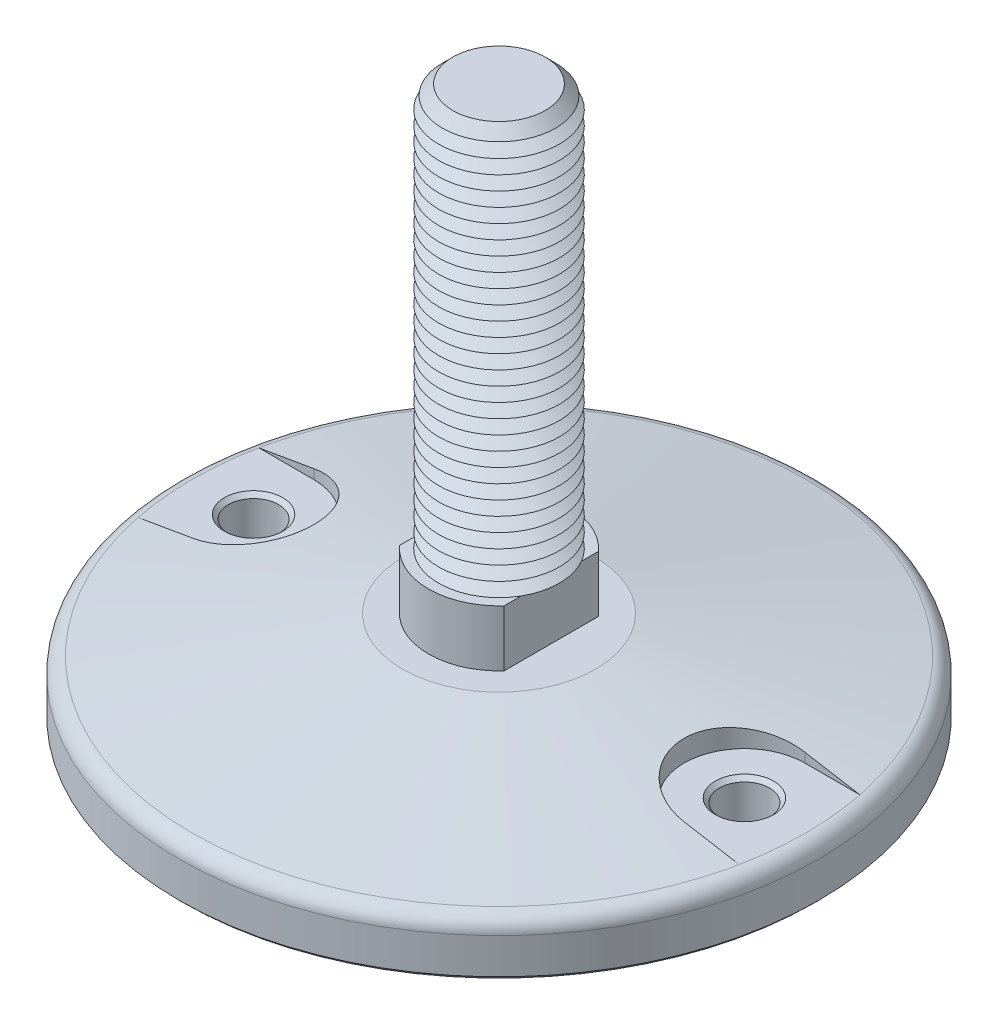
ISO-10303-21;
HEADER;
FILE_DESCRIPTION(('STEP AP214'),'2;1');
FILE_NAME('part.step','',(''),(''),'','','');
FILE_SCHEMA(('AUTOMOTIVE_DESIGN { 1 0 10303 214 1 1 1 1 }'));
ENDSEC;
DATA;
#1=APPLICATION_CONTEXT('core data for automotive mechanical design processes');
#2=APPLICATION_PROTOCOL_DEFINITION('international standard','automotive_design',2000,#1);
#3=PRODUCT_CONTEXT('',#1,'mechanical');
#4=PRODUCT('Part','Part','',(#3));
#5=PRODUCT_RELATED_PRODUCT_CATEGORY('part','',(#4));
#6=PRODUCT_DEFINITION_FORMATION('','',#4);
#7=PRODUCT_DEFINITION_CONTEXT('part definition',#1,'design');
#8=PRODUCT_DEFINITION('design','',#6,#7);
#9=PRODUCT_DEFINITION_SHAPE('','',#8);
#10=(LENGTH_UNIT() NAMED_UNIT(*) SI_UNIT(.MILLI.,.METRE.));
#11=(NAMED_UNIT(*) PLANE_ANGLE_UNIT() SI_UNIT($,.RADIAN.));
#12=(NAMED_UNIT(*) SI_UNIT($,.STERADIAN.) SOLID_ANGLE_UNIT());
#13=UNCERTAINTY_MEASURE_WITH_UNIT(LENGTH_MEASURE(1.E-05),#10,'distance_accuracy_value','');
#14=(GEOMETRIC_REPRESENTATION_CONTEXT(3) GLOBAL_UNCERTAINTY_ASSIGNED_CONTEXT((#13)) GLOBAL_UNIT_ASSIGNED_CONTEXT((#10,
#11,#12)) REPRESENTATION_CONTEXT('',''));
#15=CARTESIAN_POINT('',(0.,0.,0.));
#16=DIRECTION('',(0.,0.,1.));
#17=DIRECTION('',(1.,0.,0.));
#18=AXIS2_PLACEMENT_3D('',#15,#16,#17);
#19=CARTESIAN_POINT('',(0.,0.,0.));
#20=DIRECTION('',(0.,-1.,0.));
#21=DIRECTION('',(0.,0.,-1.));
#22=AXIS2_PLACEMENT_3D('',#19,#20,#21);
#23=CONICAL_SURFACE('',#22,24.,1.39626340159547);
#24=CARTESIAN_POINT('',(-61.0002,-6.84455305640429,14.9999999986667));
#25=CARTESIAN_POINT('',(-60.5719080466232,-6.77122530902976,15.0000486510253));
#26=CARTESIAN_POINT('',(-60.1437494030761,-6.69717888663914,14.981669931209));
#27=CARTESIAN_POINT('',(-59.2907529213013,-6.54813452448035,14.9084324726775));
#28=CARTESIAN_POINT('',(-58.865914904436,-6.47313663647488,14.8535757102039));
#29=CARTESIAN_POINT('',(-58.0227762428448,-6.32270449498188,14.7077930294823));
#30=CARTESIAN_POINT('',(-57.6044724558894,-6.24727047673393,14.6168850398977));
#31=CARTESIAN_POINT('',(-56.7771541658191,-6.09645264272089,14.3996686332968));
#32=CARTESIAN_POINT('',(-56.3681395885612,-6.02106882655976,14.2733604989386));
#33=CARTESIAN_POINT('',(-55.5621199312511,-5.87087312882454,13.986156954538));
#34=CARTESIAN_POINT('',(-55.1651202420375,-5.79606151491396,13.8252462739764));
#35=CARTESIAN_POINT('',(-54.3861487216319,-5.64763733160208,13.4699748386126));
#36=CARTESIAN_POINT('',(-54.0041768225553,-5.57402475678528,13.2756142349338));
#37=CARTESIAN_POINT('',(-53.2580678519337,-5.42864124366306,12.8548003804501));
#38=CARTESIAN_POINT('',(-52.8939274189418,-5.35686995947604,12.6283532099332));
#39=CARTESIAN_POINT('',(-52.186041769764,-5.21581901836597,12.1448693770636));
#40=CARTESIAN_POINT('',(-51.8422964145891,-5.14653934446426,11.8878329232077));
#41=CARTESIAN_POINT('',(-51.1785561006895,-5.01133737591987,11.3455904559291));
#42=CARTESIAN_POINT('',(-50.8585036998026,-4.94540709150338,11.0604567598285));
#43=CARTESIAN_POINT('',(-50.2435776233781,-4.81743482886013,10.463413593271));
#44=CARTESIAN_POINT('',(-49.948704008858,-4.75539286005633,10.1515040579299));
#45=CARTESIAN_POINT('',(-49.3863482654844,-4.6359259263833,9.5030156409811));
#46=CARTESIAN_POINT('',(-49.1188689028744,-4.57850142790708,9.16643427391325));
#47=CARTESIAN_POINT('',(-48.6134211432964,-4.46901587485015,8.47097635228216));
#48=CARTESIAN_POINT('',(-48.3754523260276,-4.41695474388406,8.11210011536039));
#49=CARTESIAN_POINT('',(-47.9343068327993,-4.31966643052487,7.38020662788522));
#50=CARTESIAN_POINT('',(-47.7306564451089,-4.27434742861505,7.00748710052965));
#51=CARTESIAN_POINT('',(-47.3554457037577,-4.19027418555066,6.24551642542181));
#52=CARTESIAN_POINT('',(-47.1838850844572,-4.15151989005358,5.85626541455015));
#53=CARTESIAN_POINT('',(-46.8742907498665,-4.08118572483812,5.06410373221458));
#54=CARTESIAN_POINT('',(-46.7362508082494,-4.04960452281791,4.66119561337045));
#55=CARTESIAN_POINT('',(-46.4948208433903,-3.99412823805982,3.84461191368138));
#56=CARTESIAN_POINT('',(-46.3914302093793,-3.97023301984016,3.43093652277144));
#57=CARTESIAN_POINT('',(-46.2221429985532,-3.93099396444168,2.60545435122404));
#58=CARTESIAN_POINT('',(-46.1554440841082,-3.91546729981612,2.19382064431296));
#59=CARTESIAN_POINT('',(-46.0565351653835,-3.8924103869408,1.36621022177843));
#60=CARTESIAN_POINT('',(-46.0243246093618,-3.88488001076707,0.950233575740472));
#61=CARTESIAN_POINT('',(-45.9946646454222,-3.87794669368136,0.117003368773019));
#62=CARTESIAN_POINT('',(-45.9972129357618,-3.87854321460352,-0.300250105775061));
#63=CARTESIAN_POINT('',(-46.0370435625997,-3.88785198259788,-1.13300367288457));
#64=CARTESIAN_POINT('',(-46.0743257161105,-3.89656418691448,-1.54850377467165));
#65=CARTESIAN_POINT('',(-46.182543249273,-3.92177454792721,-2.36891759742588));
#66=CARTESIAN_POINT('',(-46.2529993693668,-3.93816180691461,-2.77389806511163));
#67=CARTESIAN_POINT('',(-46.4267978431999,-3.97840764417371,-3.57635456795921));
#68=CARTESIAN_POINT('',(-46.5301398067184,-4.00226613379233,-3.97383069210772));
#69=CARTESIAN_POINT('',(-46.7688882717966,-4.05707448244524,-4.75853501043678));
#70=CARTESIAN_POINT('',(-46.9042953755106,-4.08802447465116,-5.14576301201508));
#71=CARTESIAN_POINT('',(-47.206117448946,-4.15654424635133,-5.90733280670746));
#72=CARTESIAN_POINT('',(-47.3725327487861,-4.19411409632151,-6.28167446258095));
#73=CARTESIAN_POINT('',(-47.7365717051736,-4.27566086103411,-7.01794010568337));
#74=CARTESIAN_POINT('',(-47.9344367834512,-4.31968711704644,-7.37973923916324));
#75=CARTESIAN_POINT('',(-48.3589021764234,-4.41331257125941,-8.08530451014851));
#76=CARTESIAN_POINT('',(-48.5855025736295,-4.46291178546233,-8.42907059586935));
#77=CARTESIAN_POINT('',(-49.0657858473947,-4.56705084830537,-9.09634650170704));
#78=CARTESIAN_POINT('',(-49.3194694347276,-4.62159082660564,-9.41985578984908));
#79=CARTESIAN_POINT('',(-49.8521052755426,-4.73496487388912,-10.0445475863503));
#80=CARTESIAN_POINT('',(-50.131057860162,-4.79379899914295,-10.3457298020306));
#81=CARTESIAN_POINT('',(-50.7186282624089,-4.91644106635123,-10.9301791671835));
#82=CARTESIAN_POINT('',(-51.0277601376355,-4.98032946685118,-11.2129127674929));
#83=CARTESIAN_POINT('',(-51.6681809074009,-5.11124627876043,-11.7512616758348));
#84=CARTESIAN_POINT('',(-51.9994702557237,-5.17827475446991,-12.0068764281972));
#85=CARTESIAN_POINT('',(-52.6820261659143,-5.31484958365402,-12.489438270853));
#86=CARTESIAN_POINT('',(-53.0333008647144,-5.38439695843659,-12.7163735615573));
#87=CARTESIAN_POINT('',(-53.7532696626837,-5.52535961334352,-13.1399905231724));
#88=CARTESIAN_POINT('',(-54.1219634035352,-5.59677485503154,-13.3366728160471));
#89=CARTESIAN_POINT('',(-54.8815627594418,-5.74228287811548,-13.7020352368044));
#90=CARTESIAN_POINT('',(-55.2727604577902,-5.81640072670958,-13.8700983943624));
#91=CARTESIAN_POINT('',(-56.0678984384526,-5.9653752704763,-14.1723417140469));
#92=CARTESIAN_POINT('',(-56.4718387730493,-6.04023196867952,-14.3065217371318));
#93=CARTESIAN_POINT('',(-57.2891056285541,-6.19003340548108,-14.5399332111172));
#94=CARTESIAN_POINT('',(-57.7024198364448,-6.26497791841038,-14.6392079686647));
#95=CARTESIAN_POINT('',(-58.5358762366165,-6.4145012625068,-14.8023063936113));
#96=CARTESIAN_POINT('',(-58.9560150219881,-6.48908025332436,-14.8661472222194));
#97=CARTESIAN_POINT('',(-59.6475646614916,-6.61057728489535,-14.9413662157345));
#98=CARTESIAN_POINT('',(-59.9178207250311,-6.65774602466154,-14.9633673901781));
#99=CARTESIAN_POINT('',(-60.458759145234,-6.75155340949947,-14.9926755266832));
#100=CARTESIAN_POINT('',(-60.7294400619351,-6.79819280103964,-15.000006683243));
#101=CARTESIAN_POINT('',(-61.0002,-6.84455305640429,-14.9999999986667));
#102=B_SPLINE_CURVE_WITH_KNOTS('',3,(#24,#25,#26,#27,#28,#29,#30,#31,#32,#33,#34,#35,#36,#37,
#38,#39,#40,#41,#42,#43,#44,#45,#46,#47,#48,#49,#50,#51,#52,#53,#54,#55,#56,#57,#58,#59,#60,#61,
#62,#63,#64,#65,#66,#67,#68,#69,#70,#71,#72,#73,#74,#75,#76,#77,#78,#79,#80,#81,#82,#83,#84,#85,
#86,#87,#88,#89,#90,#91,#92,#93,#94,#95,#96,#97,#98,#99,#100,#101),.UNSPECIFIED.,.F.,.F.,(4,2,2,
2,2,2,2,2,2,2,2,2,2,2,2,2,2,2,2,2,2,2,2,2,2,2,2,2,2,2,2,2,2,2,2,2,2,2,4),(0.,1.30316757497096,
2.6062645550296,3.9087143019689,5.21115364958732,6.51416896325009,7.81717839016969,
9.11994123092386,10.4226951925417,11.722179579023,13.0216671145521,14.3212857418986,
15.620885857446,16.9007390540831,18.1805816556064,19.4601863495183,20.7397684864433,
21.9901285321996,23.2404685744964,24.4907258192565,25.7409764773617,26.9736945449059,
28.2063979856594,29.4391245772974,30.6718642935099,31.9145698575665,33.1572789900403,
34.4000207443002,35.6427787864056,36.912623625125,38.1824944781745,39.4528861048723,
40.7232516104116,42.0182516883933,43.3132570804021,44.6066500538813,45.8994160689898,
46.7247199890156,47.5486616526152),.UNSPECIFIED.);
#103=CARTESIAN_POINT('',(-61.,-6.84451881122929,15.));
#104=VERTEX_POINT('',#103);
#105=CARTESIAN_POINT('',(-61.,-6.84451881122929,-15.));
#106=VERTEX_POINT('',#105);
#107=EDGE_CURVE('E502',#104,#106,#102,.T.);
#108=ORIENTED_EDGE('',*,*,#107,.F.);
#109=CARTESIAN_POINT('',(-104.042185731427,-14.3032773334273,15.));
#110=CARTESIAN_POINT('',(-101.426826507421,-13.8468501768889,15.));
#111=CARTESIAN_POINT('',(-98.8114117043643,-13.3907410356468,15.));
#112=CARTESIAN_POINT('',(-93.5804323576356,-12.4793845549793,15.));
#113=CARTESIAN_POINT('',(-90.964867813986,-12.0241372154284,15.));
#114=CARTESIAN_POINT('',(-85.7335581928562,-11.1147314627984,15.));
#115=CARTESIAN_POINT('',(-83.1178131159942,-10.6605730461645,15.));
#116=CARTESIAN_POINT('',(-77.8860747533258,-9.75368383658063,15.));
#117=CARTESIAN_POINT('',(-75.2700814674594,-9.30095304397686,15.));
#118=CARTESIAN_POINT('',(-70.0377535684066,-8.39740791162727,15.));
#119=CARTESIAN_POINT('',(-67.4214189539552,-7.94659357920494,15.));
#120=CARTESIAN_POINT('',(-62.1882957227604,-7.04761438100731,15.));
#121=CARTESIAN_POINT('',(-59.5715071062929,-6.59944951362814,15.));
#122=CARTESIAN_POINT('',(-55.6458288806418,-5.93007736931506,15.));
#123=CARTESIAN_POINT('',(-54.3371844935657,-5.70743210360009,15.));
#124=CARTESIAN_POINT('',(-51.7196954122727,-5.26332337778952,15.));
#125=CARTESIAN_POINT('',(-50.4108507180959,-5.04185991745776,15.));
#126=CARTESIAN_POINT('',(-47.7929137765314,-4.60038366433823,15.));
#127=CARTESIAN_POINT('',(-46.4838215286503,-4.38037087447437,15.));
#128=CARTESIAN_POINT('',(-43.8653264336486,-3.94219643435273,15.));
#129=CARTESIAN_POINT('',(-42.5559235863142,-3.72403478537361,15.));
#130=CARTESIAN_POINT('',(-41.2463335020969,-3.50699886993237,15.));
#131=B_SPLINE_CURVE_WITH_KNOTS('',3,(#109,#110,#111,#112,#113,#114,#115,#116,#117,#118,#119,
#120,#121,#122,#123,#124,#125,#126,#127,#128,#129,#130),.UNSPECIFIED.,.F.,.F.,(4,2,2,2,2,2,2,2,
2,2,4),(0.,7.96466371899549,15.9293262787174,23.8939628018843,31.8586012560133,39.8232701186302,
47.7879341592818,51.7702809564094,55.7526269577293,59.734980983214,63.7173377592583),.UNSPECIFIED.);
#132=CARTESIAN_POINT('',(-74.6843450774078,-9.2,15.));
#133=VERTEX_POINT('',#132);
#134=EDGE_CURVE('E476',#133,#104,#131,.T.);
#135=ORIENTED_EDGE('',*,*,#134,.F.);
#136=CARTESIAN_POINT('',(0.,-9.2,0.));
#137=DIRECTION('',(0.,1.,0.));
#138=DIRECTION('',(0.,0.,1.));
#139=AXIS2_PLACEMENT_3D('',#136,#137,#138);
#140=CIRCLE('',#139,76.175792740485);
#141=CARTESIAN_POINT('',(-74.6843450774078,-9.2,-15.));
#142=VERTEX_POINT('',#141);
#143=EDGE_CURVE('E460',#133,#142,#140,.F.);
#144=ORIENTED_EDGE('',*,*,#143,.T.);
#145=CARTESIAN_POINT('',(-41.2463335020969,-3.50699886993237,-15.));
#146=CARTESIAN_POINT('',(-42.5559235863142,-3.72403478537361,-15.));
#147=CARTESIAN_POINT('',(-43.8653264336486,-3.94219643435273,-15.));
#148=CARTESIAN_POINT('',(-46.4838215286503,-4.38037087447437,-15.));
#149=CARTESIAN_POINT('',(-47.7929137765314,-4.60038366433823,-15.));
#150=CARTESIAN_POINT('',(-50.4108507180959,-5.04185991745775,-15.));
#151=CARTESIAN_POINT('',(-51.7196954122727,-5.26332337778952,-15.));
#152=CARTESIAN_POINT('',(-54.3371844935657,-5.70743210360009,-15.));
#153=CARTESIAN_POINT('',(-55.6458288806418,-5.93007736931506,-15.));
#154=CARTESIAN_POINT('',(-59.5715071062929,-6.59944951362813,-15.));
#155=CARTESIAN_POINT('',(-62.1882957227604,-7.04761438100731,-15.));
#156=CARTESIAN_POINT('',(-67.4214189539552,-7.94659357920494,-15.));
#157=CARTESIAN_POINT('',(-70.0377535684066,-8.39740791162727,-15.));
#158=CARTESIAN_POINT('',(-75.2700814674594,-9.30095304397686,-15.));
#159=CARTESIAN_POINT('',(-77.8860747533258,-9.75368383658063,-15.));
#160=CARTESIAN_POINT('',(-83.1178131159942,-10.6605730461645,-15.));
#161=CARTESIAN_POINT('',(-85.7335581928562,-11.1147314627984,-15.));
#162=CARTESIAN_POINT('',(-90.964867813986,-12.0241372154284,-15.));
#163=CARTESIAN_POINT('',(-93.5804323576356,-12.4793845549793,-15.));
#164=CARTESIAN_POINT('',(-98.8114117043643,-13.3907410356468,-15.));
#165=CARTESIAN_POINT('',(-101.426826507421,-13.8468501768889,-15.));
#166=CARTESIAN_POINT('',(-104.042185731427,-14.3032773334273,-15.));
#167=B_SPLINE_CURVE_WITH_KNOTS('',3,(#145,#146,#147,#148,#149,#150,#151,#152,#153,#154,#155,
#156,#157,#158,#159,#160,#161,#162,#163,#164,#165,#166),.UNSPECIFIED.,.F.,.F.,(4,2,2,2,2,2,2,2,
2,2,4),(0.,3.98235677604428,7.96471080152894,11.9470568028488,15.9294035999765,23.8940676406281,
31.8587365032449,39.8233749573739,47.7880114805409,55.7526740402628,63.7173377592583),.UNSPECIFIED.);
#168=EDGE_CURVE('E468',#106,#142,#167,.T.);
#169=ORIENTED_EDGE('',*,*,#168,.F.);
#170=EDGE_LOOP('',(#108,#135,#144,#169));
#171=FACE_BOUND('',#170,.T.);
#172=CARTESIAN_POINT('',(0.,-9.20331494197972,0.));
#173=DIRECTION('',(0.,1.,0.));
#174=DIRECTION('',(0.,0.,1.));
#175=AXIS2_PLACEMENT_3D('',#172,#173,#174);
#176=CIRCLE('',#175,76.1945927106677);
#177=CARTESIAN_POINT('',(0.,-9.20331494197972,76.1945927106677));
#178=VERTEX_POINT('',#177);
#179=EDGE_CURVE('E449',#178,#178,#176,.T.);
#180=ORIENTED_EDGE('',*,*,#179,.T.);
#181=EDGE_LOOP('',(#180));
#182=FACE_BOUND('',#181,.T.);
#183=CARTESIAN_POINT('',(0.,0.,0.));
#184=DIRECTION('',(0.,1.,0.));
#185=DIRECTION('',(0.,0.,1.));
#186=AXIS2_PLACEMENT_3D('',#183,#184,#185);
#187=CIRCLE('',#186,24.);
#188=CARTESIAN_POINT('',(0.,0.,24.));
#189=VERTEX_POINT('',#188);
#190=EDGE_CURVE('E445',#189,#189,#187,.T.);
#191=ORIENTED_EDGE('',*,*,#190,.F.);
#192=EDGE_LOOP('',(#191));
#193=FACE_BOUND('',#192,.T.);
#194=CARTESIAN_POINT('',(94.0652754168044,-12.563957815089,15.));
#195=CARTESIAN_POINT('',(91.449731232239,-12.1085412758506,15.));
#196=CARTESIAN_POINT('',(88.8341137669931,-11.653544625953,15.));
#197=CARTESIAN_POINT('',(83.6026721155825,-10.7447399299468,15.));
#198=CARTESIAN_POINT('',(80.9868479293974,-10.2909318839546,15.));
#199=CARTESIAN_POINT('',(75.7549567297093,-9.38485738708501,15.));
#200=CARTESIAN_POINT('',(73.1388897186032,-8.93259092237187,15.));
#201=CARTESIAN_POINT('',(67.9063931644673,-8.03014521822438,15.));
#202=CARTESIAN_POINT('',(65.2899636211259,-7.57996598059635,15.));
#203=CARTESIAN_POINT('',(60.0565735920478,-6.68252310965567,15.));
#204=CARTESIAN_POINT('',(57.4396131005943,-6.2352595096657,15.));
#205=CARTESIAN_POINT('',(52.2049769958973,-5.34496105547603,15.));
#206=CARTESIAN_POINT('',(49.5873013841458,-4.90192619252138,15.));
#207=CARTESIAN_POINT('',(45.659951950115,-4.24226428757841,15.));
#208=CARTESIAN_POINT('',(44.3506891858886,-4.02319090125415,15.));
#209=CARTESIAN_POINT('',(41.7318168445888,-3.58713211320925,15.));
#210=CARTESIAN_POINT('',(40.4222072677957,-3.3701467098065,15.));
#211=CARTESIAN_POINT('',(37.8025367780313,-2.93885600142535,15.));
#212=CARTESIAN_POINT('',(36.4924758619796,-2.72455071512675,15.));
#213=CARTESIAN_POINT('',(34.5269525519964,-2.40574421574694,15.));
#214=CARTESIAN_POINT('',(33.8717052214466,-2.29991714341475,15.));
#215=CARTESIAN_POINT('',(32.5610443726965,-2.08929455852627,15.));
#216=CARTESIAN_POINT('',(31.9056308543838,-1.98449904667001,15.));
#217=CARTESIAN_POINT('',(31.2501232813,-1.88029321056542,15.));
#218=B_SPLINE_CURVE_WITH_KNOTS('',3,(#194,#195,#196,#197,#198,#199,#200,#201,#202,#203,#204,
#205,#206,#207,#208,#209,#210,#211,#212,#213,#214,#215,#216,#217),.UNSPECIFIED.,.F.,.F.,(4,2,2,
2,2,2,2,2,2,2,2,4),(0.,7.96468982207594,15.9293804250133,23.8939993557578,31.8586251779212,
39.82334186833,47.7880420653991,51.7704344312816,55.7528235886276,59.7352404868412,
61.7264544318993,63.7176697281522),.UNSPECIFIED.);
#219=CARTESIAN_POINT('',(74.6843450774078,-9.2,15.));
#220=VERTEX_POINT('',#219);
#221=CARTESIAN_POINT('',(61.,-6.84451881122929,15.));
#222=VERTEX_POINT('',#221);
#223=EDGE_CURVE('E133',#220,#222,#218,.T.);
#224=ORIENTED_EDGE('',*,*,#223,.T.);
#225=CARTESIAN_POINT('',(61.0002,-6.84455305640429,14.9999999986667));
#226=CARTESIAN_POINT('',(60.5719080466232,-6.77122530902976,15.0000486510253));
#227=CARTESIAN_POINT('',(60.1437494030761,-6.69717888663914,14.981669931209));
#228=CARTESIAN_POINT('',(59.2907529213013,-6.54813452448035,14.9084324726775));
#229=CARTESIAN_POINT('',(58.865914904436,-6.47313663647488,14.8535757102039));
#230=CARTESIAN_POINT('',(58.0227762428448,-6.32270449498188,14.7077930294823));
#231=CARTESIAN_POINT('',(57.6044724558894,-6.24727047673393,14.6168850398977));
#232=CARTESIAN_POINT('',(56.7771541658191,-6.09645264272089,14.3996686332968));
#233=CARTESIAN_POINT('',(56.3681395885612,-6.02106882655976,14.2733604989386));
#234=CARTESIAN_POINT('',(55.5621199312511,-5.87087312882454,13.986156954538));
#235=CARTESIAN_POINT('',(55.1651202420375,-5.79606151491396,13.8252462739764));
#236=CARTESIAN_POINT('',(54.3861487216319,-5.64763733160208,13.4699748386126));
#237=CARTESIAN_POINT('',(54.0041768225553,-5.57402475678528,13.2756142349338));
#238=CARTESIAN_POINT('',(53.2580678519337,-5.42864124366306,12.8548003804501));
#239=CARTESIAN_POINT('',(52.8939274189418,-5.35686995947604,12.6283532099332));
#240=CARTESIAN_POINT('',(52.186041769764,-5.21581901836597,12.1448693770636));
#241=CARTESIAN_POINT('',(51.8422964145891,-5.14653934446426,11.8878329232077));
#242=CARTESIAN_POINT('',(51.1785561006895,-5.01133737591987,11.3455904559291));
#243=CARTESIAN_POINT('',(50.8585036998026,-4.94540709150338,11.0604567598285));
#244=CARTESIAN_POINT('',(50.2435776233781,-4.81743482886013,10.463413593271));
#245=CARTESIAN_POINT('',(49.948704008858,-4.75539286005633,10.1515040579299));
#246=CARTESIAN_POINT('',(49.3863482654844,-4.6359259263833,9.5030156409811));
#247=CARTESIAN_POINT('',(49.1188689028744,-4.57850142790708,9.16643427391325));
#248=CARTESIAN_POINT('',(48.6134211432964,-4.46901587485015,8.47097635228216));
#249=CARTESIAN_POINT('',(48.3754523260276,-4.41695474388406,8.11210011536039));
#250=CARTESIAN_POINT('',(47.9343068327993,-4.31966643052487,7.38020662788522));
#251=CARTESIAN_POINT('',(47.7306564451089,-4.27434742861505,7.00748710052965));
#252=CARTESIAN_POINT('',(47.3554457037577,-4.19027418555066,6.24551642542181));
#253=CARTESIAN_POINT('',(47.1838850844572,-4.15151989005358,5.85626541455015));
#254=CARTESIAN_POINT('',(46.8742907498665,-4.08118572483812,5.06410373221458));
#255=CARTESIAN_POINT('',(46.7362508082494,-4.04960452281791,4.66119561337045));
#256=CARTESIAN_POINT('',(46.4948208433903,-3.99412823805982,3.84461191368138));
#257=CARTESIAN_POINT('',(46.3914302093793,-3.97023301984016,3.43093652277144));
#258=CARTESIAN_POINT('',(46.2221429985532,-3.93099396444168,2.60545435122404));
#259=CARTESIAN_POINT('',(46.1554440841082,-3.91546729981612,2.19382064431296));
#260=CARTESIAN_POINT('',(46.0565351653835,-3.8924103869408,1.36621022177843));
#261=CARTESIAN_POINT('',(46.0243246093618,-3.88488001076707,0.950233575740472));
#262=CARTESIAN_POINT('',(45.9946646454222,-3.87794669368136,0.117003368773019));
#263=CARTESIAN_POINT('',(45.9972129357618,-3.87854321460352,-0.300250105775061));
#264=CARTESIAN_POINT('',(46.0370435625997,-3.88785198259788,-1.13300367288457));
#265=CARTESIAN_POINT('',(46.0743257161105,-3.89656418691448,-1.54850377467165));
#266=CARTESIAN_POINT('',(46.182543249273,-3.92177454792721,-2.36891759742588));
#267=CARTESIAN_POINT('',(46.2529993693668,-3.93816180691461,-2.77389806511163));
#268=CARTESIAN_POINT('',(46.4267978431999,-3.97840764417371,-3.57635456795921));
#269=CARTESIAN_POINT('',(46.5301398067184,-4.00226613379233,-3.97383069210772));
#270=CARTESIAN_POINT('',(46.7688882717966,-4.05707448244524,-4.75853501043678));
#271=CARTESIAN_POINT('',(46.9042953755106,-4.08802447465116,-5.14576301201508));
#272=CARTESIAN_POINT('',(47.206117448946,-4.15654424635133,-5.90733280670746));
#273=CARTESIAN_POINT('',(47.3725327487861,-4.19411409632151,-6.28167446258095));
#274=CARTESIAN_POINT('',(47.7365717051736,-4.27566086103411,-7.01794010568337));
#275=CARTESIAN_POINT('',(47.9344367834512,-4.31968711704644,-7.37973923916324));
#276=CARTESIAN_POINT('',(48.3589021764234,-4.41331257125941,-8.08530451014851));
#277=CARTESIAN_POINT('',(48.5855025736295,-4.46291178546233,-8.42907059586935));
#278=CARTESIAN_POINT('',(49.0657858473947,-4.56705084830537,-9.09634650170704));
#279=CARTESIAN_POINT('',(49.3194694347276,-4.62159082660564,-9.41985578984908));
#280=CARTESIAN_POINT('',(49.8521052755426,-4.73496487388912,-10.0445475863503));
#281=CARTESIAN_POINT('',(50.131057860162,-4.79379899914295,-10.3457298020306));
#282=CARTESIAN_POINT('',(50.7186282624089,-4.91644106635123,-10.9301791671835));
#283=CARTESIAN_POINT('',(51.0277601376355,-4.98032946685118,-11.2129127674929));
#284=CARTESIAN_POINT('',(51.6681809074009,-5.11124627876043,-11.7512616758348));
#285=CARTESIAN_POINT('',(51.9994702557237,-5.17827475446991,-12.0068764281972));
#286=CARTESIAN_POINT('',(52.6820261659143,-5.31484958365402,-12.489438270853));
#287=CARTESIAN_POINT('',(53.0333008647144,-5.38439695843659,-12.7163735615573));
#288=CARTESIAN_POINT('',(53.7532696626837,-5.52535961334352,-13.1399905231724));
#289=CARTESIAN_POINT('',(54.1219634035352,-5.59677485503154,-13.3366728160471));
#290=CARTESIAN_POINT('',(54.8815627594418,-5.74228287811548,-13.7020352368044));
#291=CARTESIAN_POINT('',(55.2727604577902,-5.81640072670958,-13.8700983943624));
#292=CARTESIAN_POINT('',(56.0678984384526,-5.9653752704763,-14.1723417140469));
#293=CARTESIAN_POINT('',(56.4718387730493,-6.04023196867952,-14.3065217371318));
#294=CARTESIAN_POINT('',(57.2891056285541,-6.19003340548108,-14.5399332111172));
#295=CARTESIAN_POINT('',(57.7024198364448,-6.26497791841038,-14.6392079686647));
#296=CARTESIAN_POINT('',(58.5358762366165,-6.4145012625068,-14.8023063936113));
#297=CARTESIAN_POINT('',(58.9560150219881,-6.48908025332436,-14.8661472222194));
#298=CARTESIAN_POINT('',(59.6475646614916,-6.61057728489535,-14.9413662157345));
#299=CARTESIAN_POINT('',(59.9178207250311,-6.65774602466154,-14.9633673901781));
#300=CARTESIAN_POINT('',(60.458759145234,-6.75155340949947,-14.9926755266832));
#301=CARTESIAN_POINT('',(60.7294400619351,-6.79819280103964,-15.000006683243));
#302=CARTESIAN_POINT('',(61.0002,-6.84455305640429,-14.9999999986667));
#303=B_SPLINE_CURVE_WITH_KNOTS('',3,(#225,#226,#227,#228,#229,#230,#231,#232,#233,#234,#235,
#236,#237,#238,#239,#240,#241,#242,#243,#244,#245,#246,#247,#248,#249,#250,#251,#252,#253,#254,
#255,#256,#257,#258,#259,#260,#261,#262,#263,#264,#265,#266,#267,#268,#269,#270,#271,#272,#273,
#274,#275,#276,#277,#278,#279,#280,#281,#282,#283,#284,#285,#286,#287,#288,#289,#290,#291,#292,
#293,#294,#295,#296,#297,#298,#299,#300,#301,#302),.UNSPECIFIED.,.F.,.F.,(4,2,2,2,2,2,2,2,2,2,2,
2,2,2,2,2,2,2,2,2,2,2,2,2,2,2,2,2,2,2,2,2,2,2,2,2,2,2,4),(0.,1.30316757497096,2.6062645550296,
3.9087143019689,5.21115364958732,6.51416896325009,7.81717839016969,9.11994123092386,
10.4226951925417,11.722179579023,13.0216671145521,14.3212857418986,15.620885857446,
16.9007390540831,18.1805816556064,19.4601863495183,20.7397684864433,21.9901285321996,
23.2404685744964,24.4907258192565,25.7409764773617,26.9736945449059,28.2063979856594,
29.4391245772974,30.6718642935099,31.9145698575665,33.1572789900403,34.4000207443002,
35.6427787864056,36.912623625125,38.1824944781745,39.4528861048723,40.7232516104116,
42.0182516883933,43.3132570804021,44.6066500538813,45.8994160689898,46.7247199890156,
47.5486616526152),.UNSPECIFIED.);
#304=CARTESIAN_POINT('',(61.,-6.84451881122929,-15.));
#305=VERTEX_POINT('',#304);
#306=EDGE_CURVE('E145',#222,#305,#303,.T.);
#307=ORIENTED_EDGE('',*,*,#306,.T.);
#308=CARTESIAN_POINT('',(31.2501232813,-1.88029321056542,-15.));
#309=CARTESIAN_POINT('',(31.9056308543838,-1.98449904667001,-15.));
#310=CARTESIAN_POINT('',(32.5610443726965,-2.08929455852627,-15.));
#311=CARTESIAN_POINT('',(33.8717052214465,-2.29991714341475,-15.));
#312=CARTESIAN_POINT('',(34.5269525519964,-2.40574421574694,-15.));
#313=CARTESIAN_POINT('',(36.4924758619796,-2.72455071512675,-15.));
#314=CARTESIAN_POINT('',(37.8025367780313,-2.93885600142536,-15.));
#315=CARTESIAN_POINT('',(40.4222072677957,-3.3701467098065,-15.));
#316=CARTESIAN_POINT('',(41.7318168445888,-3.58713211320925,-15.));
#317=CARTESIAN_POINT('',(44.3506891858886,-4.02319090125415,-15.));
#318=CARTESIAN_POINT('',(45.659951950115,-4.24226428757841,-15.));
#319=CARTESIAN_POINT('',(49.5873013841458,-4.90192619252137,-15.));
#320=CARTESIAN_POINT('',(52.2049769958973,-5.34496105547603,-15.));
#321=CARTESIAN_POINT('',(57.4396131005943,-6.2352595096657,-15.));
#322=CARTESIAN_POINT('',(60.0565735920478,-6.68252310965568,-15.));
#323=CARTESIAN_POINT('',(65.2899636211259,-7.57996598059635,-15.));
#324=CARTESIAN_POINT('',(67.9063931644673,-8.03014521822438,-15.));
#325=CARTESIAN_POINT('',(73.1388897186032,-8.93259092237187,-15.));
#326=CARTESIAN_POINT('',(75.7549567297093,-9.38485738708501,-15.));
#327=CARTESIAN_POINT('',(80.9868479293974,-10.2909318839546,-15.));
#328=CARTESIAN_POINT('',(83.6026721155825,-10.7447399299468,-15.));
#329=CARTESIAN_POINT('',(88.8341137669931,-11.653544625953,-15.));
#330=CARTESIAN_POINT('',(91.449731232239,-12.1085412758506,-15.));
#331=CARTESIAN_POINT('',(94.0652754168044,-12.563957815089,-15.));
#332=B_SPLINE_CURVE_WITH_KNOTS('',3,(#308,#309,#310,#311,#312,#313,#314,#315,#316,#317,#318,
#319,#320,#321,#322,#323,#324,#325,#326,#327,#328,#329,#330,#331),.UNSPECIFIED.,.F.,.F.,(4,2,2,
2,2,2,2,2,2,2,2,4),(0.,1.99121529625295,3.98242924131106,7.96484613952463,11.9472352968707,
15.9296276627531,23.8943278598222,31.859044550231,39.8236703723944,47.7882893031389,
55.7529799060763,63.7176697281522),.UNSPECIFIED.);
#333=CARTESIAN_POINT('',(74.6843450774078,-9.2,-15.));
#334=VERTEX_POINT('',#333);
#335=EDGE_CURVE('E533',#305,#334,#332,.T.);
#336=ORIENTED_EDGE('',*,*,#335,.T.);
#337=CARTESIAN_POINT('',(0.,-9.2,0.));
#338=DIRECTION('',(0.,1.,0.));
#339=DIRECTION('',(0.,0.,1.));
#340=AXIS2_PLACEMENT_3D('',#337,#338,#339);
#341=CIRCLE('',#340,76.175792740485);
#342=EDGE_CURVE('E524',#334,#220,#341,.F.);
#343=ORIENTED_EDGE('',*,*,#342,.T.);
#344=EDGE_LOOP('',(#224,#307,#336,#343));
#345=FACE_BOUND('',#344,.T.);
#346=ADVANCED_FACE('F39',(#171,#182,#193,#345),#23,.T.);
#347=CARTESIAN_POINT('',(0.,14.,0.));
#348=DIRECTION('',(0.,1.,0.));
#349=DIRECTION('',(0.,0.,1.));
#350=AXIS2_PLACEMENT_3D('',#347,#348,#349);
#351=PLANE('',#350);
#352=CARTESIAN_POINT('',(0.,14.,0.));
#353=DIRECTION('',(0.,1.,0.));
#354=DIRECTION('',(0.,0.,1.));
#355=AXIS2_PLACEMENT_3D('',#352,#353,#354);
#356=CIRCLE('',#355,15.);
#357=CARTESIAN_POINT('',(13.,14.,-7.48331477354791));
#358=VERTEX_POINT('',#357);
#359=CARTESIAN_POINT('',(-13.,14.,-7.48331477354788));
#360=VERTEX_POINT('',#359);
#361=EDGE_CURVE('E461',#358,#360,#356,.T.);
#362=ORIENTED_EDGE('',*,*,#361,.F.);
#363=DIRECTION('',(0.,0.,1.));
#364=VECTOR('',#363,1.);
#365=CARTESIAN_POINT('',(13.,14.,11.71537451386));
#366=LINE('',#365,#364);
#367=CARTESIAN_POINT('',(13.,14.,-11.71537451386));
#368=VERTEX_POINT('',#367);
#369=EDGE_CURVE('E424',#368,#358,#366,.T.);
#370=ORIENTED_EDGE('',*,*,#369,.F.);
#371=CARTESIAN_POINT('',(0.,14.,0.));
#372=DIRECTION('',(0.,1.,0.));
#373=DIRECTION('',(0.,0.,1.));
#374=AXIS2_PLACEMENT_3D('',#371,#372,#373);
#375=CIRCLE('',#374,17.5);
#376=CARTESIAN_POINT('',(-13.,14.,-11.71537451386));
#377=VERTEX_POINT('',#376);
#378=EDGE_CURVE('E438',#368,#377,#375,.T.);
#379=ORIENTED_EDGE('',*,*,#378,.T.);
#380=DIRECTION('',(0.,0.,-1.));
#381=VECTOR('',#380,1.);
#382=CARTESIAN_POINT('',(-13.,14.,-11.71537451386));
#383=LINE('',#382,#381);
#384=EDGE_CURVE('E411',#360,#377,#383,.T.);
#385=ORIENTED_EDGE('',*,*,#384,.F.);
#386=EDGE_LOOP('',(#362,#370,#379,#385));
#387=FACE_BOUND('',#386,.T.);
#388=ADVANCED_FACE('F588',(#387),#351,.T.);
#389=CARTESIAN_POINT('',(0.,14.,0.));
#390=DIRECTION('',(0.,-1.,0.));
#391=DIRECTION('',(0.,0.,-1.));
#392=AXIS2_PLACEMENT_3D('',#389,#390,#391);
#393=CYLINDRICAL_SURFACE('',#392,17.5);
#394=CARTESIAN_POINT('',(-13.,14.,11.71537451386));
#395=VERTEX_POINT('',#394);
#396=CARTESIAN_POINT('',(13.,14.,11.71537451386));
#397=VERTEX_POINT('',#396);
#398=EDGE_CURVE('E416',#395,#397,#375,.T.);
#399=ORIENTED_EDGE('',*,*,#398,.F.);
#400=DIRECTION('',(0.,1.,0.));
#401=VECTOR('',#400,1.);
#402=CARTESIAN_POINT('',(-13.,0.,11.71537451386));
#403=LINE('',#402,#401);
#404=CARTESIAN_POINT('',(-13.,0.,11.71537451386));
#405=VERTEX_POINT('',#404);
#406=EDGE_CURVE('E405',#405,#395,#403,.T.);
#407=ORIENTED_EDGE('',*,*,#406,.F.);
#408=CARTESIAN_POINT('',(0.,0.,0.));
#409=DIRECTION('',(0.,1.,0.));
#410=DIRECTION('',(0.,0.,1.));
#411=AXIS2_PLACEMENT_3D('',#408,#409,#410);
#412=CIRCLE('',#411,17.5);
#413=CARTESIAN_POINT('',(13.,0.,11.71537451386));
#414=VERTEX_POINT('',#413);
#415=EDGE_CURVE('E439',#405,#414,#412,.T.);
#416=ORIENTED_EDGE('',*,*,#415,.T.);
#417=DIRECTION('',(0.,1.,0.));
#418=VECTOR('',#417,1.);
#419=CARTESIAN_POINT('',(13.,0.,11.71537451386));
#420=LINE('',#419,#418);
#421=EDGE_CURVE('E429',#414,#397,#420,.T.);
#422=ORIENTED_EDGE('',*,*,#421,.T.);
#423=EDGE_LOOP('',(#399,#407,#416,#422));
#424=FACE_BOUND('',#423,.T.);
#425=ADVANCED_FACE('F593',(#424),#393,.T.);
#426=CARTESIAN_POINT('',(0.,0.,0.));
#427=DIRECTION('',(0.,1.,0.));
#428=DIRECTION('',(0.,0.,1.));
#429=AXIS2_PLACEMENT_3D('',#426,#427,#428);
#430=PLANE('',#429);
#431=CARTESIAN_POINT('',(13.,0.,-11.71537451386));
#432=VERTEX_POINT('',#431);
#433=CARTESIAN_POINT('',(-13.,0.,-11.71537451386));
#434=VERTEX_POINT('',#433);
#435=EDGE_CURVE('E443',#432,#434,#412,.T.);
#436=ORIENTED_EDGE('',*,*,#435,.F.);
#437=DIRECTION('',(0.,0.,1.));
#438=VECTOR('',#437,1.);
#439=CARTESIAN_POINT('',(13.,0.,11.71537451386));
#440=LINE('',#439,#438);
#441=EDGE_CURVE('E419',#432,#414,#440,.T.);
#442=ORIENTED_EDGE('',*,*,#441,.T.);
#443=ORIENTED_EDGE('',*,*,#415,.F.);
#444=DIRECTION('',(0.,0.,-1.));
#445=VECTOR('',#444,1.);
#446=CARTESIAN_POINT('',(-13.,0.,-11.71537451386));
#447=LINE('',#446,#445);
#448=EDGE_CURVE('E401',#405,#434,#447,.T.);
#449=ORIENTED_EDGE('',*,*,#448,.T.);
#450=EDGE_LOOP('',(#436,#442,#443,#449));
#451=FACE_BOUND('',#450,.T.);
#452=ORIENTED_EDGE('',*,*,#190,.T.);
#453=EDGE_LOOP('',(#452));
#454=FACE_BOUND('',#453,.T.);
#455=ADVANCED_FACE('F660',(#451,#454),#430,.T.);
#456=CARTESIAN_POINT('',(0.,61.3388655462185,0.));
#457=DIRECTION('',(0.,1.,0.));
#458=DIRECTION('',(0.,0.,1.));
#459=AXIS2_PLACEMENT_3D('',#456,#457,#458);
#460=CYLINDRICAL_SURFACE('',#459,79.5);
#461=CARTESIAN_POINT('',(0.,-22.,0.));
#462=DIRECTION('',(0.,-1.,0.));
#463=DIRECTION('',(0.,0.,-1.));
#464=AXIS2_PLACEMENT_3D('',#461,#462,#463);
#465=CIRCLE('',#464,79.5);
#466=CARTESIAN_POINT('',(0.,-22.,-79.5));
#467=VERTEX_POINT('',#466);
#468=EDGE_CURVE('E48',#467,#467,#465,.F.);
#469=ORIENTED_EDGE('',*,*,#468,.T.);
#470=EDGE_LOOP('',(#469));
#471=FACE_BOUND('',#470,.T.);
#472=CARTESIAN_POINT('',(0.,-13.1425459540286,0.));
#473=DIRECTION('',(0.,-1.,0.));
#474=DIRECTION('',(0.,0.,-1.));
#475=AXIS2_PLACEMENT_3D('',#472,#473,#474);
#476=CIRCLE('',#475,79.5);
#477=CARTESIAN_POINT('',(0.,-13.1425459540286,-79.5));
#478=VERTEX_POINT('',#477);
#479=EDGE_CURVE('E444',#478,#478,#476,.T.);
#480=ORIENTED_EDGE('',*,*,#479,.T.);
#481=EDGE_LOOP('',(#480));
#482=FACE_BOUND('',#481,.T.);
#483=ADVANCED_FACE('F575',(#471,#482),#460,.T.);
#484=CARTESIAN_POINT('',(0.,-23.,79.5));
#485=DIRECTION('',(0.,-1.,0.));
#486=DIRECTION('',(0.,0.,-1.));
#487=AXIS2_PLACEMENT_3D('',#484,#485,#486);
#488=PLANE('',#487);
#489=CARTESIAN_POINT('',(0.,-23.,0.));
#490=DIRECTION('',(0.,-1.,0.));
#491=DIRECTION('',(0.,0.,-1.));
#492=AXIS2_PLACEMENT_3D('',#489,#490,#491);
#493=CIRCLE('',#492,78.5);
#494=CARTESIAN_POINT('',(0.,-23.,-78.5));
#495=VERTEX_POINT('',#494);
#496=EDGE_CURVE('E11',#495,#495,#493,.T.);
#497=ORIENTED_EDGE('',*,*,#496,.T.);
#498=EDGE_LOOP('',(#497));
#499=FACE_BOUND('',#498,.T.);
#500=CARTESIAN_POINT('',(61.,-23.,0.));
#501=DIRECTION('',(0.,-1.,0.));
#502=DIRECTION('',(0.,0.,-1.));
#503=AXIS2_PLACEMENT_3D('',#500,#501,#502);
#504=CIRCLE('',#503,7.25000000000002);
#505=CARTESIAN_POINT('',(61.,-23.,-7.25000000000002));
#506=VERTEX_POINT('',#505);
#507=EDGE_CURVE('E563',#506,#506,#504,.F.);
#508=ORIENTED_EDGE('',*,*,#507,.T.);
#509=EDGE_LOOP('',(#508));
#510=FACE_BOUND('',#509,.T.);
#511=CARTESIAN_POINT('',(-61.,-23.,0.));
#512=DIRECTION('',(0.,-1.,0.));
#513=DIRECTION('',(0.,0.,-1.));
#514=AXIS2_PLACEMENT_3D('',#511,#512,#513);
#515=CIRCLE('',#514,7.24999999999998);
#516=CARTESIAN_POINT('',(-61.,-23.,-7.24999999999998));
#517=VERTEX_POINT('',#516);
#518=EDGE_CURVE('E508',#517,#517,#515,.F.);
#519=ORIENTED_EDGE('',*,*,#518,.T.);
#520=EDGE_LOOP('',(#519));
#521=FACE_BOUND('',#520,.T.);
#522=ADVANCED_FACE('F656',(#499,#510,#521),#488,.T.);
#523=CARTESIAN_POINT('',(0.,-13.1425459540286,0.));
#524=DIRECTION('',(0.,-1.,0.));
#525=DIRECTION('',(0.,0.,-1.));
#526=AXIS2_PLACEMENT_3D('',#523,#524,#525);
#527=TOROIDAL_SURFACE('',#526,75.5,4.);
#528=ORIENTED_EDGE('',*,*,#479,.F.);
#529=EDGE_LOOP('',(#528));
#530=FACE_BOUND('',#529,.T.);
#531=ORIENTED_EDGE('',*,*,#179,.F.);
#532=EDGE_LOOP('',(#531));
#533=FACE_BOUND('',#532,.T.);
#534=ADVANCED_FACE('F654',(#530,#533),#527,.T.);
#535=ORIENTED_EDGE('',*,*,#435,.T.);
#536=DIRECTION('',(0.,1.,0.));
#537=VECTOR('',#536,1.);
#538=CARTESIAN_POINT('',(-13.,0.,-11.71537451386));
#539=LINE('',#538,#537);
#540=EDGE_CURVE('E412',#434,#377,#539,.T.);
#541=ORIENTED_EDGE('',*,*,#540,.T.);
#542=ORIENTED_EDGE('',*,*,#378,.F.);
#543=DIRECTION('',(0.,1.,0.));
#544=VECTOR('',#543,1.);
#545=CARTESIAN_POINT('',(13.,0.,-11.71537451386));
#546=LINE('',#545,#544);
#547=EDGE_CURVE('E423',#432,#368,#546,.T.);
#548=ORIENTED_EDGE('',*,*,#547,.F.);
#549=EDGE_LOOP('',(#535,#541,#542,#548));
#550=FACE_BOUND('',#549,.T.);
#551=ADVANCED_FACE('F650',(#550),#393,.T.);
#552=CARTESIAN_POINT('',(-13.,14.,7.48331477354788));
#553=VERTEX_POINT('',#552);
#554=CARTESIAN_POINT('',(13.,14.,7.48331477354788));
#555=VERTEX_POINT('',#554);
#556=EDGE_CURVE('E400',#553,#555,#356,.T.);
#557=ORIENTED_EDGE('',*,*,#556,.F.);
#558=EDGE_CURVE('E406',#395,#553,#383,.T.);
#559=ORIENTED_EDGE('',*,*,#558,.F.);
#560=ORIENTED_EDGE('',*,*,#398,.T.);
#561=EDGE_CURVE('E399',#555,#397,#366,.T.);
#562=ORIENTED_EDGE('',*,*,#561,.F.);
#563=EDGE_LOOP('',(#557,#559,#560,#562));
#564=FACE_BOUND('',#563,.T.);
#565=ADVANCED_FACE('F596',(#564),#351,.T.);
#566=CARTESIAN_POINT('',(13.,0.,11.71537451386));
#567=DIRECTION('',(-1.,0.,0.));
#568=DIRECTION('',(0.,0.,1.));
#569=AXIS2_PLACEMENT_3D('',#566,#567,#568);
#570=PLANE('',#569);
#571=ORIENTED_EDGE('',*,*,#369,.T.);
#572=EDGE_CURVE('E428',#358,#555,#366,.T.);
#573=ORIENTED_EDGE('',*,*,#572,.T.);
#574=ORIENTED_EDGE('',*,*,#561,.T.);
#575=ORIENTED_EDGE('',*,*,#421,.F.);
#576=ORIENTED_EDGE('',*,*,#441,.F.);
#577=ORIENTED_EDGE('',*,*,#547,.T.);
#578=EDGE_LOOP('',(#571,#573,#574,#575,#576,#577));
#579=FACE_BOUND('',#578,.T.);
#580=ADVANCED_FACE('F640',(#579),#570,.F.);
#581=CARTESIAN_POINT('',(-13.,0.,-11.71537451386));
#582=DIRECTION('',(1.,0.,0.));
#583=DIRECTION('',(0.,0.,-1.));
#584=AXIS2_PLACEMENT_3D('',#581,#582,#583);
#585=PLANE('',#584);
#586=ORIENTED_EDGE('',*,*,#558,.T.);
#587=EDGE_CURVE('E410',#553,#360,#383,.T.);
#588=ORIENTED_EDGE('',*,*,#587,.T.);
#589=ORIENTED_EDGE('',*,*,#384,.T.);
#590=ORIENTED_EDGE('',*,*,#540,.F.);
#591=ORIENTED_EDGE('',*,*,#448,.F.);
#592=ORIENTED_EDGE('',*,*,#406,.T.);
#593=EDGE_LOOP('',(#586,#588,#589,#590,#591,#592));
#594=FACE_BOUND('',#593,.T.);
#595=ADVANCED_FACE('F628',(#594),#585,.F.);
#596=CARTESIAN_POINT('',(0.,14.,0.));
#597=DIRECTION('',(0.,1.,0.));
#598=DIRECTION('',(0.,0.,1.));
#599=AXIS2_PLACEMENT_3D('',#596,#597,#598);
#600=PLANE('',#599);
#601=ORIENTED_EDGE('',*,*,#587,.F.);
#602=EDGE_CURVE('E395',#360,#553,#356,.T.);
#603=ORIENTED_EDGE('',*,*,#602,.F.);
#604=EDGE_LOOP('',(#601,#603));
#605=FACE_BOUND('',#604,.T.);
#606=ADVANCED_FACE('F631',(#605),#600,.F.);
#607=ORIENTED_EDGE('',*,*,#572,.F.);
#608=EDGE_CURVE('E396',#555,#358,#356,.T.);
#609=ORIENTED_EDGE('',*,*,#608,.F.);
#610=EDGE_LOOP('',(#607,#609));
#611=FACE_BOUND('',#610,.T.);
#612=ADVANCED_FACE('F633',(#611),#600,.F.);
#613=CARTESIAN_POINT('',(0.,14.,0.));
#614=DIRECTION('',(0.,-1.,0.));
#615=DIRECTION('',(0.,0.,-1.));
#616=AXIS2_PLACEMENT_3D('',#613,#614,#615);
#617=CONICAL_SURFACE('',#616,15.,1.0471975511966);
#618=CARTESIAN_POINT('',(0.,15.75,0.));
#619=DIRECTION('',(0.,1.,0.));
#620=DIRECTION('',(0.,0.,1.));
#621=AXIS2_PLACEMENT_3D('',#618,#619,#620);
#622=CIRCLE('',#621,11.9689110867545);
#623=CARTESIAN_POINT('',(0.,15.75,11.9689110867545));
#624=VERTEX_POINT('',#623);
#625=EDGE_CURVE('E391',#624,#624,#622,.T.);
#626=ORIENTED_EDGE('',*,*,#625,.F.);
#627=EDGE_LOOP('',(#626));
#628=FACE_BOUND('',#627,.T.);
#629=ORIENTED_EDGE('',*,*,#608,.T.);
#630=ORIENTED_EDGE('',*,*,#361,.T.);
#631=ORIENTED_EDGE('',*,*,#602,.T.);
#632=ORIENTED_EDGE('',*,*,#556,.T.);
#633=EDGE_LOOP('',(#629,#630,#631,#632));
#634=FACE_BOUND('',#633,.T.);
#635=ADVANCED_FACE('F620',(#628,#634),#617,.T.);
#636=CARTESIAN_POINT('',(0.,15.75,0.));
#637=DIRECTION('',(0.,1.,0.));
#638=DIRECTION('',(0.,0.,1.));
#639=AXIS2_PLACEMENT_3D('',#636,#637,#638);
#640=CONICAL_SURFACE('',#639,11.9689110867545,1.0471975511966);
#641=CARTESIAN_POINT('',(0.,17.5,0.));
#642=DIRECTION('',(0.,1.,0.));
#643=DIRECTION('',(0.,0.,1.));
#644=AXIS2_PLACEMENT_3D('',#641,#642,#643);
#645=CIRCLE('',#644,15.);
#646=CARTESIAN_POINT('',(0.,17.5,15.));
#647=VERTEX_POINT('',#646);
#648=EDGE_CURVE('E387',#647,#647,#645,.T.);
#649=ORIENTED_EDGE('',*,*,#648,.F.);
#650=EDGE_LOOP('',(#649));
#651=FACE_BOUND('',#650,.T.);
#652=ORIENTED_EDGE('',*,*,#625,.T.);
#653=EDGE_LOOP('',(#652));
#654=FACE_BOUND('',#653,.T.);
#655=ADVANCED_FACE('F1203',(#651,#654),#640,.T.);
#656=CARTESIAN_POINT('',(0.,17.5,0.));
#657=DIRECTION('',(0.,-1.,0.));
#658=DIRECTION('',(0.,0.,-1.));
#659=AXIS2_PLACEMENT_3D('',#656,#657,#658);
#660=CONICAL_SURFACE('',#659,15.,1.0471975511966);
#661=CARTESIAN_POINT('',(0.,19.25,0.));
#662=DIRECTION('',(0.,1.,0.));
#663=DIRECTION('',(0.,0.,1.));
#664=AXIS2_PLACEMENT_3D('',#661,#662,#663);
#665=CIRCLE('',#664,11.9689110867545);
#666=CARTESIAN_POINT('',(0.,19.25,11.9689110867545));
#667=VERTEX_POINT('',#666);
#668=EDGE_CURVE('E383',#667,#667,#665,.T.);
#669=ORIENTED_EDGE('',*,*,#668,.F.);
#670=EDGE_LOOP('',(#669));
#671=FACE_BOUND('',#670,.T.);
#672=ORIENTED_EDGE('',*,*,#648,.T.);
#673=EDGE_LOOP('',(#672));
#674=FACE_BOUND('',#673,.T.);
#675=ADVANCED_FACE('F1196',(#671,#674),#660,.T.);
#676=CARTESIAN_POINT('',(0.,19.25,0.));
#677=DIRECTION('',(0.,1.,0.));
#678=DIRECTION('',(0.,0.,1.));
#679=AXIS2_PLACEMENT_3D('',#676,#677,#678);
#680=CONICAL_SURFACE('',#679,11.9689110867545,1.0471975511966);
#681=CARTESIAN_POINT('',(0.,21.,0.));
#682=DIRECTION('',(0.,1.,0.));
#683=DIRECTION('',(0.,0.,1.));
#684=AXIS2_PLACEMENT_3D('',#681,#682,#683);
#685=CIRCLE('',#684,15.);
#686=CARTESIAN_POINT('',(0.,21.,15.));
#687=VERTEX_POINT('',#686);
#688=EDGE_CURVE('E379',#687,#687,#685,.T.);
#689=ORIENTED_EDGE('',*,*,#688,.F.);
#690=EDGE_LOOP('',(#689));
#691=FACE_BOUND('',#690,.T.);
#692=ORIENTED_EDGE('',*,*,#668,.T.);
#693=EDGE_LOOP('',(#692));
#694=FACE_BOUND('',#693,.T.);
#695=ADVANCED_FACE('F1189',(#691,#694),#680,.T.);
#696=CARTESIAN_POINT('',(0.,21.,0.));
#697=DIRECTION('',(0.,-1.,0.));
#698=DIRECTION('',(0.,0.,-1.));
#699=AXIS2_PLACEMENT_3D('',#696,#697,#698);
#700=CONICAL_SURFACE('',#699,15.,1.0471975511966);
#701=CARTESIAN_POINT('',(0.,22.75,0.));
#702=DIRECTION('',(0.,1.,0.));
#703=DIRECTION('',(0.,0.,1.));
#704=AXIS2_PLACEMENT_3D('',#701,#702,#703);
#705=CIRCLE('',#704,11.9689110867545);
#706=CARTESIAN_POINT('',(0.,22.75,11.9689110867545));
#707=VERTEX_POINT('',#706);
#708=EDGE_CURVE('E375',#707,#707,#705,.T.);
#709=ORIENTED_EDGE('',*,*,#708,.F.);
#710=EDGE_LOOP('',(#709));
#711=FACE_BOUND('',#710,.T.);
#712=ORIENTED_EDGE('',*,*,#688,.T.);
#713=EDGE_LOOP('',(#712));
#714=FACE_BOUND('',#713,.T.);
#715=ADVANCED_FACE('F1182',(#711,#714),#700,.T.);
#716=CARTESIAN_POINT('',(0.,22.75,0.));
#717=DIRECTION('',(0.,1.,0.));
#718=DIRECTION('',(0.,0.,1.));
#719=AXIS2_PLACEMENT_3D('',#716,#717,#718);
#720=CONICAL_SURFACE('',#719,11.9689110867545,1.0471975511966);
#721=CARTESIAN_POINT('',(0.,24.5,0.));
#722=DIRECTION('',(0.,1.,0.));
#723=DIRECTION('',(0.,0.,1.));
#724=AXIS2_PLACEMENT_3D('',#721,#722,#723);
#725=CIRCLE('',#724,15.);
#726=CARTESIAN_POINT('',(0.,24.5,15.));
#727=VERTEX_POINT('',#726);
#728=EDGE_CURVE('E371',#727,#727,#725,.T.);
#729=ORIENTED_EDGE('',*,*,#728,.F.);
#730=EDGE_LOOP('',(#729));
#731=FACE_BOUND('',#730,.T.);
#732=ORIENTED_EDGE('',*,*,#708,.T.);
#733=EDGE_LOOP('',(#732));
#734=FACE_BOUND('',#733,.T.);
#735=ADVANCED_FACE('F1175',(#731,#734),#720,.T.);
#736=CARTESIAN_POINT('',(0.,24.5,0.));
#737=DIRECTION('',(0.,-1.,0.));
#738=DIRECTION('',(0.,0.,-1.));
#739=AXIS2_PLACEMENT_3D('',#736,#737,#738);
#740=CONICAL_SURFACE('',#739,15.,1.0471975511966);
#741=CARTESIAN_POINT('',(0.,26.25,0.));
#742=DIRECTION('',(0.,1.,0.));
#743=DIRECTION('',(0.,0.,1.));
#744=AXIS2_PLACEMENT_3D('',#741,#742,#743);
#745=CIRCLE('',#744,11.9689110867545);
#746=CARTESIAN_POINT('',(0.,26.25,11.9689110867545));
#747=VERTEX_POINT('',#746);
#748=EDGE_CURVE('E367',#747,#747,#745,.T.);
#749=ORIENTED_EDGE('',*,*,#748,.F.);
#750=EDGE_LOOP('',(#749));
#751=FACE_BOUND('',#750,.T.);
#752=ORIENTED_EDGE('',*,*,#728,.T.);
#753=EDGE_LOOP('',(#752));
#754=FACE_BOUND('',#753,.T.);
#755=ADVANCED_FACE('F1168',(#751,#754),#740,.T.);
#756=CARTESIAN_POINT('',(0.,26.25,0.));
#757=DIRECTION('',(0.,1.,0.));
#758=DIRECTION('',(0.,0.,1.));
#759=AXIS2_PLACEMENT_3D('',#756,#757,#758);
#760=CONICAL_SURFACE('',#759,11.9689110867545,1.0471975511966);
#761=CARTESIAN_POINT('',(0.,28.,0.));
#762=DIRECTION('',(0.,1.,0.));
#763=DIRECTION('',(0.,0.,1.));
#764=AXIS2_PLACEMENT_3D('',#761,#762,#763);
#765=CIRCLE('',#764,15.);
#766=CARTESIAN_POINT('',(0.,28.,15.));
#767=VERTEX_POINT('',#766);
#768=EDGE_CURVE('E363',#767,#767,#765,.T.);
#769=ORIENTED_EDGE('',*,*,#768,.F.);
#770=EDGE_LOOP('',(#769));
#771=FACE_BOUND('',#770,.T.);
#772=ORIENTED_EDGE('',*,*,#748,.T.);
#773=EDGE_LOOP('',(#772));
#774=FACE_BOUND('',#773,.T.);
#775=ADVANCED_FACE('F1161',(#771,#774),#760,.T.);
#776=CARTESIAN_POINT('',(0.,28.,0.));
#777=DIRECTION('',(0.,-1.,0.));
#778=DIRECTION('',(0.,0.,-1.));
#779=AXIS2_PLACEMENT_3D('',#776,#777,#778);
#780=CONICAL_SURFACE('',#779,15.,1.0471975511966);
#781=CARTESIAN_POINT('',(0.,29.75,0.));
#782=DIRECTION('',(0.,1.,0.));
#783=DIRECTION('',(0.,0.,1.));
#784=AXIS2_PLACEMENT_3D('',#781,#782,#783);
#785=CIRCLE('',#784,11.9689110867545);
#786=CARTESIAN_POINT('',(0.,29.75,11.9689110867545));
#787=VERTEX_POINT('',#786);
#788=EDGE_CURVE('E359',#787,#787,#785,.T.);
#789=ORIENTED_EDGE('',*,*,#788,.F.);
#790=EDGE_LOOP('',(#789));
#791=FACE_BOUND('',#790,.T.);
#792=ORIENTED_EDGE('',*,*,#768,.T.);
#793=EDGE_LOOP('',(#792));
#794=FACE_BOUND('',#793,.T.);
#795=ADVANCED_FACE('F1154',(#791,#794),#780,.T.);
#796=CARTESIAN_POINT('',(0.,29.75,0.));
#797=DIRECTION('',(0.,1.,0.));
#798=DIRECTION('',(0.,0.,1.));
#799=AXIS2_PLACEMENT_3D('',#796,#797,#798);
#800=CONICAL_SURFACE('',#799,11.9689110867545,1.0471975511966);
#801=CARTESIAN_POINT('',(0.,31.5,0.));
#802=DIRECTION('',(0.,1.,0.));
#803=DIRECTION('',(0.,0.,1.));
#804=AXIS2_PLACEMENT_3D('',#801,#802,#803);
#805=CIRCLE('',#804,15.);
#806=CARTESIAN_POINT('',(0.,31.5,15.));
#807=VERTEX_POINT('',#806);
#808=EDGE_CURVE('E355',#807,#807,#805,.T.);
#809=ORIENTED_EDGE('',*,*,#808,.F.);
#810=EDGE_LOOP('',(#809));
#811=FACE_BOUND('',#810,.T.);
#812=ORIENTED_EDGE('',*,*,#788,.T.);
#813=EDGE_LOOP('',(#812));
#814=FACE_BOUND('',#813,.T.);
#815=ADVANCED_FACE('F1147',(#811,#814),#800,.T.);
#816=CARTESIAN_POINT('',(0.,31.5,0.));
#817=DIRECTION('',(0.,-1.,0.));
#818=DIRECTION('',(0.,0.,-1.));
#819=AXIS2_PLACEMENT_3D('',#816,#817,#818);
#820=CONICAL_SURFACE('',#819,15.,1.0471975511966);
#821=CARTESIAN_POINT('',(0.,33.25,0.));
#822=DIRECTION('',(0.,1.,0.));
#823=DIRECTION('',(0.,0.,1.));
#824=AXIS2_PLACEMENT_3D('',#821,#822,#823);
#825=CIRCLE('',#824,11.9689110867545);
#826=CARTESIAN_POINT('',(0.,33.25,11.9689110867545));
#827=VERTEX_POINT('',#826);
#828=EDGE_CURVE('E351',#827,#827,#825,.T.);
#829=ORIENTED_EDGE('',*,*,#828,.F.);
#830=EDGE_LOOP('',(#829));
#831=FACE_BOUND('',#830,.T.);
#832=ORIENTED_EDGE('',*,*,#808,.T.);
#833=EDGE_LOOP('',(#832));
#834=FACE_BOUND('',#833,.T.);
#835=ADVANCED_FACE('F1140',(#831,#834),#820,.T.);
#836=CARTESIAN_POINT('',(0.,33.25,0.));
#837=DIRECTION('',(0.,1.,0.));
#838=DIRECTION('',(0.,0.,1.));
#839=AXIS2_PLACEMENT_3D('',#836,#837,#838);
#840=CONICAL_SURFACE('',#839,11.9689110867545,1.0471975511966);
#841=CARTESIAN_POINT('',(0.,35.,0.));
#842=DIRECTION('',(0.,1.,0.));
#843=DIRECTION('',(0.,0.,1.));
#844=AXIS2_PLACEMENT_3D('',#841,#842,#843);
#845=CIRCLE('',#844,15.);
#846=CARTESIAN_POINT('',(0.,35.,15.));
#847=VERTEX_POINT('',#846);
#848=EDGE_CURVE('E347',#847,#847,#845,.T.);
#849=ORIENTED_EDGE('',*,*,#848,.F.);
#850=EDGE_LOOP('',(#849));
#851=FACE_BOUND('',#850,.T.);
#852=ORIENTED_EDGE('',*,*,#828,.T.);
#853=EDGE_LOOP('',(#852));
#854=FACE_BOUND('',#853,.T.);
#855=ADVANCED_FACE('F1133',(#851,#854),#840,.T.);
#856=CARTESIAN_POINT('',(0.,35.,0.));
#857=DIRECTION('',(0.,-1.,0.));
#858=DIRECTION('',(0.,0.,-1.));
#859=AXIS2_PLACEMENT_3D('',#856,#857,#858);
#860=CONICAL_SURFACE('',#859,15.,1.0471975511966);
#861=CARTESIAN_POINT('',(0.,36.75,0.));
#862=DIRECTION('',(0.,1.,0.));
#863=DIRECTION('',(0.,0.,1.));
#864=AXIS2_PLACEMENT_3D('',#861,#862,#863);
#865=CIRCLE('',#864,11.9689110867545);
#866=CARTESIAN_POINT('',(0.,36.75,11.9689110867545));
#867=VERTEX_POINT('',#866);
#868=EDGE_CURVE('E343',#867,#867,#865,.T.);
#869=ORIENTED_EDGE('',*,*,#868,.F.);
#870=EDGE_LOOP('',(#869));
#871=FACE_BOUND('',#870,.T.);
#872=ORIENTED_EDGE('',*,*,#848,.T.);
#873=EDGE_LOOP('',(#872));
#874=FACE_BOUND('',#873,.T.);
#875=ADVANCED_FACE('F1126',(#871,#874),#860,.T.);
#876=CARTESIAN_POINT('',(0.,36.75,0.));
#877=DIRECTION('',(0.,1.,0.));
#878=DIRECTION('',(0.,0.,1.));
#879=AXIS2_PLACEMENT_3D('',#876,#877,#878);
#880=CONICAL_SURFACE('',#879,11.9689110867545,1.0471975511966);
#881=CARTESIAN_POINT('',(0.,38.5,0.));
#882=DIRECTION('',(0.,1.,0.));
#883=DIRECTION('',(0.,0.,1.));
#884=AXIS2_PLACEMENT_3D('',#881,#882,#883);
#885=CIRCLE('',#884,15.);
#886=CARTESIAN_POINT('',(0.,38.5,15.));
#887=VERTEX_POINT('',#886);
#888=EDGE_CURVE('E339',#887,#887,#885,.T.);
#889=ORIENTED_EDGE('',*,*,#888,.F.);
#890=EDGE_LOOP('',(#889));
#891=FACE_BOUND('',#890,.T.);
#892=ORIENTED_EDGE('',*,*,#868,.T.);
#893=EDGE_LOOP('',(#892));
#894=FACE_BOUND('',#893,.T.);
#895=ADVANCED_FACE('F1119',(#891,#894),#880,.T.);
#896=CARTESIAN_POINT('',(0.,38.5,0.));
#897=DIRECTION('',(0.,-1.,0.));
#898=DIRECTION('',(0.,0.,-1.));
#899=AXIS2_PLACEMENT_3D('',#896,#897,#898);
#900=CONICAL_SURFACE('',#899,15.,1.0471975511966);
#901=CARTESIAN_POINT('',(0.,40.25,0.));
#902=DIRECTION('',(0.,1.,0.));
#903=DIRECTION('',(0.,0.,1.));
#904=AXIS2_PLACEMENT_3D('',#901,#902,#903);
#905=CIRCLE('',#904,11.9689110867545);
#906=CARTESIAN_POINT('',(0.,40.25,11.9689110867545));
#907=VERTEX_POINT('',#906);
#908=EDGE_CURVE('E335',#907,#907,#905,.T.);
#909=ORIENTED_EDGE('',*,*,#908,.F.);
#910=EDGE_LOOP('',(#909));
#911=FACE_BOUND('',#910,.T.);
#912=ORIENTED_EDGE('',*,*,#888,.T.);
#913=EDGE_LOOP('',(#912));
#914=FACE_BOUND('',#913,.T.);
#915=ADVANCED_FACE('F1112',(#911,#914),#900,.T.);
#916=CARTESIAN_POINT('',(0.,40.25,0.));
#917=DIRECTION('',(0.,1.,0.));
#918=DIRECTION('',(0.,0.,1.));
#919=AXIS2_PLACEMENT_3D('',#916,#917,#918);
#920=CONICAL_SURFACE('',#919,11.9689110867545,1.0471975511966);
#921=CARTESIAN_POINT('',(0.,42.,0.));
#922=DIRECTION('',(0.,1.,0.));
#923=DIRECTION('',(0.,0.,1.));
#924=AXIS2_PLACEMENT_3D('',#921,#922,#923);
#925=CIRCLE('',#924,15.);
#926=CARTESIAN_POINT('',(0.,42.,15.));
#927=VERTEX_POINT('',#926);
#928=EDGE_CURVE('E331',#927,#927,#925,.T.);
#929=ORIENTED_EDGE('',*,*,#928,.F.);
#930=EDGE_LOOP('',(#929));
#931=FACE_BOUND('',#930,.T.);
#932=ORIENTED_EDGE('',*,*,#908,.T.);
#933=EDGE_LOOP('',(#932));
#934=FACE_BOUND('',#933,.T.);
#935=ADVANCED_FACE('F1105',(#931,#934),#920,.T.);
#936=CARTESIAN_POINT('',(0.,42.,0.));
#937=DIRECTION('',(0.,-1.,0.));
#938=DIRECTION('',(0.,0.,-1.));
#939=AXIS2_PLACEMENT_3D('',#936,#937,#938);
#940=CONICAL_SURFACE('',#939,15.,1.0471975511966);
#941=CARTESIAN_POINT('',(0.,43.75,0.));
#942=DIRECTION('',(0.,1.,0.));
#943=DIRECTION('',(0.,0.,1.));
#944=AXIS2_PLACEMENT_3D('',#941,#942,#943);
#945=CIRCLE('',#944,11.9689110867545);
#946=CARTESIAN_POINT('',(0.,43.75,11.9689110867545));
#947=VERTEX_POINT('',#946);
#948=EDGE_CURVE('E327',#947,#947,#945,.T.);
#949=ORIENTED_EDGE('',*,*,#948,.F.);
#950=EDGE_LOOP('',(#949));
#951=FACE_BOUND('',#950,.T.);
#952=ORIENTED_EDGE('',*,*,#928,.T.);
#953=EDGE_LOOP('',(#952));
#954=FACE_BOUND('',#953,.T.);
#955=ADVANCED_FACE('F1098',(#951,#954),#940,.T.);
#956=CARTESIAN_POINT('',(0.,43.75,0.));
#957=DIRECTION('',(0.,1.,0.));
#958=DIRECTION('',(0.,0.,1.));
#959=AXIS2_PLACEMENT_3D('',#956,#957,#958);
#960=CONICAL_SURFACE('',#959,11.9689110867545,1.0471975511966);
#961=CARTESIAN_POINT('',(0.,45.5,0.));
#962=DIRECTION('',(0.,1.,0.));
#963=DIRECTION('',(0.,0.,1.));
#964=AXIS2_PLACEMENT_3D('',#961,#962,#963);
#965=CIRCLE('',#964,15.);
#966=CARTESIAN_POINT('',(0.,45.5,15.));
#967=VERTEX_POINT('',#966);
#968=EDGE_CURVE('E323',#967,#967,#965,.T.);
#969=ORIENTED_EDGE('',*,*,#968,.F.);
#970=EDGE_LOOP('',(#969));
#971=FACE_BOUND('',#970,.T.);
#972=ORIENTED_EDGE('',*,*,#948,.T.);
#973=EDGE_LOOP('',(#972));
#974=FACE_BOUND('',#973,.T.);
#975=ADVANCED_FACE('F1091',(#971,#974),#960,.T.);
#976=CARTESIAN_POINT('',(0.,45.5,0.));
#977=DIRECTION('',(0.,-1.,0.));
#978=DIRECTION('',(0.,0.,-1.));
#979=AXIS2_PLACEMENT_3D('',#976,#977,#978);
#980=CONICAL_SURFACE('',#979,15.,1.0471975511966);
#981=CARTESIAN_POINT('',(0.,47.25,0.));
#982=DIRECTION('',(0.,1.,0.));
#983=DIRECTION('',(0.,0.,1.));
#984=AXIS2_PLACEMENT_3D('',#981,#982,#983);
#985=CIRCLE('',#984,11.9689110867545);
#986=CARTESIAN_POINT('',(0.,47.25,11.9689110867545));
#987=VERTEX_POINT('',#986);
#988=EDGE_CURVE('E319',#987,#987,#985,.T.);
#989=ORIENTED_EDGE('',*,*,#988,.F.);
#990=EDGE_LOOP('',(#989));
#991=FACE_BOUND('',#990,.T.);
#992=ORIENTED_EDGE('',*,*,#968,.T.);
#993=EDGE_LOOP('',(#992));
#994=FACE_BOUND('',#993,.T.);
#995=ADVANCED_FACE('F1084',(#991,#994),#980,.T.);
#996=CARTESIAN_POINT('',(0.,47.25,0.));
#997=DIRECTION('',(0.,1.,0.));
#998=DIRECTION('',(0.,0.,1.));
#999=AXIS2_PLACEMENT_3D('',#996,#997,#998);
#1000=CONICAL_SURFACE('',#999,11.9689110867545,1.0471975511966);
#1001=CARTESIAN_POINT('',(0.,49.,0.));
#1002=DIRECTION('',(0.,1.,0.));
#1003=DIRECTION('',(0.,0.,1.));
#1004=AXIS2_PLACEMENT_3D('',#1001,#1002,#1003);
#1005=CIRCLE('',#1004,15.);
#1006=CARTESIAN_POINT('',(0.,49.,15.));
#1007=VERTEX_POINT('',#1006);
#1008=EDGE_CURVE('E315',#1007,#1007,#1005,.T.);
#1009=ORIENTED_EDGE('',*,*,#1008,.F.);
#1010=EDGE_LOOP('',(#1009));
#1011=FACE_BOUND('',#1010,.T.);
#1012=ORIENTED_EDGE('',*,*,#988,.T.);
#1013=EDGE_LOOP('',(#1012));
#1014=FACE_BOUND('',#1013,.T.);
#1015=ADVANCED_FACE('F1077',(#1011,#1014),#1000,.T.);
#1016=CARTESIAN_POINT('',(0.,49.,0.));
#1017=DIRECTION('',(0.,-1.,0.));
#1018=DIRECTION('',(0.,0.,-1.));
#1019=AXIS2_PLACEMENT_3D('',#1016,#1017,#1018);
#1020=CONICAL_SURFACE('',#1019,15.,1.0471975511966);
#1021=CARTESIAN_POINT('',(0.,50.75,0.));
#1022=DIRECTION('',(0.,1.,0.));
#1023=DIRECTION('',(0.,0.,1.));
#1024=AXIS2_PLACEMENT_3D('',#1021,#1022,#1023);
#1025=CIRCLE('',#1024,11.9689110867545);
#1026=CARTESIAN_POINT('',(0.,50.75,11.9689110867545));
#1027=VERTEX_POINT('',#1026);
#1028=EDGE_CURVE('E311',#1027,#1027,#1025,.T.);
#1029=ORIENTED_EDGE('',*,*,#1028,.F.);
#1030=EDGE_LOOP('',(#1029));
#1031=FACE_BOUND('',#1030,.T.);
#1032=ORIENTED_EDGE('',*,*,#1008,.T.);
#1033=EDGE_LOOP('',(#1032));
#1034=FACE_BOUND('',#1033,.T.);
#1035=ADVANCED_FACE('F1070',(#1031,#1034),#1020,.T.);
#1036=CARTESIAN_POINT('',(0.,50.75,0.));
#1037=DIRECTION('',(0.,1.,0.));
#1038=DIRECTION('',(0.,0.,1.));
#1039=AXIS2_PLACEMENT_3D('',#1036,#1037,#1038);
#1040=CONICAL_SURFACE('',#1039,11.9689110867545,1.0471975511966);
#1041=CARTESIAN_POINT('',(0.,52.5,0.));
#1042=DIRECTION('',(0.,1.,0.));
#1043=DIRECTION('',(0.,0.,1.));
#1044=AXIS2_PLACEMENT_3D('',#1041,#1042,#1043);
#1045=CIRCLE('',#1044,15.);
#1046=CARTESIAN_POINT('',(0.,52.5,15.));
#1047=VERTEX_POINT('',#1046);
#1048=EDGE_CURVE('E307',#1047,#1047,#1045,.T.);
#1049=ORIENTED_EDGE('',*,*,#1048,.F.);
#1050=EDGE_LOOP('',(#1049));
#1051=FACE_BOUND('',#1050,.T.);
#1052=ORIENTED_EDGE('',*,*,#1028,.T.);
#1053=EDGE_LOOP('',(#1052));
#1054=FACE_BOUND('',#1053,.T.);
#1055=ADVANCED_FACE('F1063',(#1051,#1054),#1040,.T.);
#1056=CARTESIAN_POINT('',(0.,52.5,0.));
#1057=DIRECTION('',(0.,-1.,0.));
#1058=DIRECTION('',(0.,0.,-1.));
#1059=AXIS2_PLACEMENT_3D('',#1056,#1057,#1058);
#1060=CONICAL_SURFACE('',#1059,15.,1.0471975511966);
#1061=CARTESIAN_POINT('',(0.,54.25,0.));
#1062=DIRECTION('',(0.,1.,0.));
#1063=DIRECTION('',(0.,0.,1.));
#1064=AXIS2_PLACEMENT_3D('',#1061,#1062,#1063);
#1065=CIRCLE('',#1064,11.9689110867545);
#1066=CARTESIAN_POINT('',(0.,54.25,11.9689110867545));
#1067=VERTEX_POINT('',#1066);
#1068=EDGE_CURVE('E303',#1067,#1067,#1065,.T.);
#1069=ORIENTED_EDGE('',*,*,#1068,.F.);
#1070=EDGE_LOOP('',(#1069));
#1071=FACE_BOUND('',#1070,.T.);
#1072=ORIENTED_EDGE('',*,*,#1048,.T.);
#1073=EDGE_LOOP('',(#1072));
#1074=FACE_BOUND('',#1073,.T.);
#1075=ADVANCED_FACE('F1056',(#1071,#1074),#1060,.T.);
#1076=CARTESIAN_POINT('',(0.,54.25,0.));
#1077=DIRECTION('',(0.,1.,0.));
#1078=DIRECTION('',(0.,0.,1.));
#1079=AXIS2_PLACEMENT_3D('',#1076,#1077,#1078);
#1080=CONICAL_SURFACE('',#1079,11.9689110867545,1.0471975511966);
#1081=CARTESIAN_POINT('',(0.,56.,0.));
#1082=DIRECTION('',(0.,1.,0.));
#1083=DIRECTION('',(0.,0.,1.));
#1084=AXIS2_PLACEMENT_3D('',#1081,#1082,#1083);
#1085=CIRCLE('',#1084,15.);
#1086=CARTESIAN_POINT('',(0.,56.,15.));
#1087=VERTEX_POINT('',#1086);
#1088=EDGE_CURVE('E299',#1087,#1087,#1085,.T.);
#1089=ORIENTED_EDGE('',*,*,#1088,.F.);
#1090=EDGE_LOOP('',(#1089));
#1091=FACE_BOUND('',#1090,.T.);
#1092=ORIENTED_EDGE('',*,*,#1068,.T.);
#1093=EDGE_LOOP('',(#1092));
#1094=FACE_BOUND('',#1093,.T.);
#1095=ADVANCED_FACE('F1049',(#1091,#1094),#1080,.T.);
#1096=CARTESIAN_POINT('',(0.,56.,0.));
#1097=DIRECTION('',(0.,-1.,0.));
#1098=DIRECTION('',(0.,0.,-1.));
#1099=AXIS2_PLACEMENT_3D('',#1096,#1097,#1098);
#1100=CONICAL_SURFACE('',#1099,15.,1.0471975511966);
#1101=CARTESIAN_POINT('',(0.,57.75,0.));
#1102=DIRECTION('',(0.,1.,0.));
#1103=DIRECTION('',(0.,0.,1.));
#1104=AXIS2_PLACEMENT_3D('',#1101,#1102,#1103);
#1105=CIRCLE('',#1104,11.9689110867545);
#1106=CARTESIAN_POINT('',(0.,57.75,11.9689110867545));
#1107=VERTEX_POINT('',#1106);
#1108=EDGE_CURVE('E295',#1107,#1107,#1105,.T.);
#1109=ORIENTED_EDGE('',*,*,#1108,.F.);
#1110=EDGE_LOOP('',(#1109));
#1111=FACE_BOUND('',#1110,.T.);
#1112=ORIENTED_EDGE('',*,*,#1088,.T.);
#1113=EDGE_LOOP('',(#1112));
#1114=FACE_BOUND('',#1113,.T.);
#1115=ADVANCED_FACE('F1042',(#1111,#1114),#1100,.T.);
#1116=CARTESIAN_POINT('',(0.,57.75,0.));
#1117=DIRECTION('',(0.,1.,0.));
#1118=DIRECTION('',(0.,0.,1.));
#1119=AXIS2_PLACEMENT_3D('',#1116,#1117,#1118);
#1120=CONICAL_SURFACE('',#1119,11.9689110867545,1.0471975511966);
#1121=CARTESIAN_POINT('',(0.,59.5,0.));
#1122=DIRECTION('',(0.,1.,0.));
#1123=DIRECTION('',(0.,0.,1.));
#1124=AXIS2_PLACEMENT_3D('',#1121,#1122,#1123);
#1125=CIRCLE('',#1124,15.);
#1126=CARTESIAN_POINT('',(0.,59.5,15.));
#1127=VERTEX_POINT('',#1126);
#1128=EDGE_CURVE('E291',#1127,#1127,#1125,.T.);
#1129=ORIENTED_EDGE('',*,*,#1128,.F.);
#1130=EDGE_LOOP('',(#1129));
#1131=FACE_BOUND('',#1130,.T.);
#1132=ORIENTED_EDGE('',*,*,#1108,.T.);
#1133=EDGE_LOOP('',(#1132));
#1134=FACE_BOUND('',#1133,.T.);
#1135=ADVANCED_FACE('F1035',(#1131,#1134),#1120,.T.);
#1136=CARTESIAN_POINT('',(0.,59.5,0.));
#1137=DIRECTION('',(0.,-1.,0.));
#1138=DIRECTION('',(0.,0.,-1.));
#1139=AXIS2_PLACEMENT_3D('',#1136,#1137,#1138);
#1140=CONICAL_SURFACE('',#1139,15.,1.0471975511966);
#1141=CARTESIAN_POINT('',(0.,61.25,0.));
#1142=DIRECTION('',(0.,1.,0.));
#1143=DIRECTION('',(0.,0.,1.));
#1144=AXIS2_PLACEMENT_3D('',#1141,#1142,#1143);
#1145=CIRCLE('',#1144,11.9689110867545);
#1146=CARTESIAN_POINT('',(0.,61.25,11.9689110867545));
#1147=VERTEX_POINT('',#1146);
#1148=EDGE_CURVE('E287',#1147,#1147,#1145,.T.);
#1149=ORIENTED_EDGE('',*,*,#1148,.F.);
#1150=EDGE_LOOP('',(#1149));
#1151=FACE_BOUND('',#1150,.T.);
#1152=ORIENTED_EDGE('',*,*,#1128,.T.);
#1153=EDGE_LOOP('',(#1152));
#1154=FACE_BOUND('',#1153,.T.);
#1155=ADVANCED_FACE('F1028',(#1151,#1154),#1140,.T.);
#1156=CARTESIAN_POINT('',(0.,61.25,0.));
#1157=DIRECTION('',(0.,1.,0.));
#1158=DIRECTION('',(0.,0.,1.));
#1159=AXIS2_PLACEMENT_3D('',#1156,#1157,#1158);
#1160=CONICAL_SURFACE('',#1159,11.9689110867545,1.0471975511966);
#1161=CARTESIAN_POINT('',(0.,63.,0.));
#1162=DIRECTION('',(0.,1.,0.));
#1163=DIRECTION('',(0.,0.,1.));
#1164=AXIS2_PLACEMENT_3D('',#1161,#1162,#1163);
#1165=CIRCLE('',#1164,15.);
#1166=CARTESIAN_POINT('',(0.,63.,15.));
#1167=VERTEX_POINT('',#1166);
#1168=EDGE_CURVE('E283',#1167,#1167,#1165,.T.);
#1169=ORIENTED_EDGE('',*,*,#1168,.F.);
#1170=EDGE_LOOP('',(#1169));
#1171=FACE_BOUND('',#1170,.T.);
#1172=ORIENTED_EDGE('',*,*,#1148,.T.);
#1173=EDGE_LOOP('',(#1172));
#1174=FACE_BOUND('',#1173,.T.);
#1175=ADVANCED_FACE('F1021',(#1171,#1174),#1160,.T.);
#1176=CARTESIAN_POINT('',(0.,63.,0.));
#1177=DIRECTION('',(0.,-1.,0.));
#1178=DIRECTION('',(0.,0.,-1.));
#1179=AXIS2_PLACEMENT_3D('',#1176,#1177,#1178);
#1180=CONICAL_SURFACE('',#1179,15.,1.0471975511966);
#1181=CARTESIAN_POINT('',(0.,64.75,0.));
#1182=DIRECTION('',(0.,1.,0.));
#1183=DIRECTION('',(0.,0.,1.));
#1184=AXIS2_PLACEMENT_3D('',#1181,#1182,#1183);
#1185=CIRCLE('',#1184,11.9689110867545);
#1186=CARTESIAN_POINT('',(0.,64.75,11.9689110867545));
#1187=VERTEX_POINT('',#1186);
#1188=EDGE_CURVE('E279',#1187,#1187,#1185,.T.);
#1189=ORIENTED_EDGE('',*,*,#1188,.F.);
#1190=EDGE_LOOP('',(#1189));
#1191=FACE_BOUND('',#1190,.T.);
#1192=ORIENTED_EDGE('',*,*,#1168,.T.);
#1193=EDGE_LOOP('',(#1192));
#1194=FACE_BOUND('',#1193,.T.);
#1195=ADVANCED_FACE('F1014',(#1191,#1194),#1180,.T.);
#1196=CARTESIAN_POINT('',(0.,64.75,0.));
#1197=DIRECTION('',(0.,1.,0.));
#1198=DIRECTION('',(0.,0.,1.));
#1199=AXIS2_PLACEMENT_3D('',#1196,#1197,#1198);
#1200=CONICAL_SURFACE('',#1199,11.9689110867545,1.0471975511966);
#1201=CARTESIAN_POINT('',(0.,66.5,0.));
#1202=DIRECTION('',(0.,1.,0.));
#1203=DIRECTION('',(0.,0.,1.));
#1204=AXIS2_PLACEMENT_3D('',#1201,#1202,#1203);
#1205=CIRCLE('',#1204,15.);
#1206=CARTESIAN_POINT('',(0.,66.5,15.));
#1207=VERTEX_POINT('',#1206);
#1208=EDGE_CURVE('E275',#1207,#1207,#1205,.T.);
#1209=ORIENTED_EDGE('',*,*,#1208,.F.);
#1210=EDGE_LOOP('',(#1209));
#1211=FACE_BOUND('',#1210,.T.);
#1212=ORIENTED_EDGE('',*,*,#1188,.T.);
#1213=EDGE_LOOP('',(#1212));
#1214=FACE_BOUND('',#1213,.T.);
#1215=ADVANCED_FACE('F1007',(#1211,#1214),#1200,.T.);
#1216=CARTESIAN_POINT('',(0.,66.5,0.));
#1217=DIRECTION('',(0.,-1.,0.));
#1218=DIRECTION('',(0.,0.,-1.));
#1219=AXIS2_PLACEMENT_3D('',#1216,#1217,#1218);
#1220=CONICAL_SURFACE('',#1219,15.,1.0471975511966);
#1221=CARTESIAN_POINT('',(0.,68.25,0.));
#1222=DIRECTION('',(0.,1.,0.));
#1223=DIRECTION('',(0.,0.,1.));
#1224=AXIS2_PLACEMENT_3D('',#1221,#1222,#1223);
#1225=CIRCLE('',#1224,11.9689110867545);
#1226=CARTESIAN_POINT('',(0.,68.25,11.9689110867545));
#1227=VERTEX_POINT('',#1226);
#1228=EDGE_CURVE('E271',#1227,#1227,#1225,.T.);
#1229=ORIENTED_EDGE('',*,*,#1228,.F.);
#1230=EDGE_LOOP('',(#1229));
#1231=FACE_BOUND('',#1230,.T.);
#1232=ORIENTED_EDGE('',*,*,#1208,.T.);
#1233=EDGE_LOOP('',(#1232));
#1234=FACE_BOUND('',#1233,.T.);
#1235=ADVANCED_FACE('F1000',(#1231,#1234),#1220,.T.);
#1236=CARTESIAN_POINT('',(0.,68.25,0.));
#1237=DIRECTION('',(0.,1.,0.));
#1238=DIRECTION('',(0.,0.,1.));
#1239=AXIS2_PLACEMENT_3D('',#1236,#1237,#1238);
#1240=CONICAL_SURFACE('',#1239,11.9689110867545,1.0471975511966);
#1241=CARTESIAN_POINT('',(0.,70.,0.));
#1242=DIRECTION('',(0.,1.,0.));
#1243=DIRECTION('',(0.,0.,1.));
#1244=AXIS2_PLACEMENT_3D('',#1241,#1242,#1243);
#1245=CIRCLE('',#1244,15.);
#1246=CARTESIAN_POINT('',(0.,70.,15.));
#1247=VERTEX_POINT('',#1246);
#1248=EDGE_CURVE('E267',#1247,#1247,#1245,.T.);
#1249=ORIENTED_EDGE('',*,*,#1248,.F.);
#1250=EDGE_LOOP('',(#1249));
#1251=FACE_BOUND('',#1250,.T.);
#1252=ORIENTED_EDGE('',*,*,#1228,.T.);
#1253=EDGE_LOOP('',(#1252));
#1254=FACE_BOUND('',#1253,.T.);
#1255=ADVANCED_FACE('F993',(#1251,#1254),#1240,.T.);
#1256=CARTESIAN_POINT('',(0.,70.,0.));
#1257=DIRECTION('',(0.,-1.,0.));
#1258=DIRECTION('',(0.,0.,-1.));
#1259=AXIS2_PLACEMENT_3D('',#1256,#1257,#1258);
#1260=CONICAL_SURFACE('',#1259,15.,1.0471975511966);
#1261=CARTESIAN_POINT('',(0.,71.75,0.));
#1262=DIRECTION('',(0.,1.,0.));
#1263=DIRECTION('',(0.,0.,1.));
#1264=AXIS2_PLACEMENT_3D('',#1261,#1262,#1263);
#1265=CIRCLE('',#1264,11.9689110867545);
#1266=CARTESIAN_POINT('',(0.,71.75,11.9689110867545));
#1267=VERTEX_POINT('',#1266);
#1268=EDGE_CURVE('E263',#1267,#1267,#1265,.T.);
#1269=ORIENTED_EDGE('',*,*,#1268,.F.);
#1270=EDGE_LOOP('',(#1269));
#1271=FACE_BOUND('',#1270,.T.);
#1272=ORIENTED_EDGE('',*,*,#1248,.T.);
#1273=EDGE_LOOP('',(#1272));
#1274=FACE_BOUND('',#1273,.T.);
#1275=ADVANCED_FACE('F986',(#1271,#1274),#1260,.T.);
#1276=CARTESIAN_POINT('',(0.,71.75,0.));
#1277=DIRECTION('',(0.,1.,0.));
#1278=DIRECTION('',(0.,0.,1.));
#1279=AXIS2_PLACEMENT_3D('',#1276,#1277,#1278);
#1280=CONICAL_SURFACE('',#1279,11.9689110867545,1.0471975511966);
#1281=CARTESIAN_POINT('',(0.,73.5,0.));
#1282=DIRECTION('',(0.,1.,0.));
#1283=DIRECTION('',(0.,0.,1.));
#1284=AXIS2_PLACEMENT_3D('',#1281,#1282,#1283);
#1285=CIRCLE('',#1284,15.);
#1286=CARTESIAN_POINT('',(0.,73.5,15.));
#1287=VERTEX_POINT('',#1286);
#1288=EDGE_CURVE('E259',#1287,#1287,#1285,.T.);
#1289=ORIENTED_EDGE('',*,*,#1288,.F.);
#1290=EDGE_LOOP('',(#1289));
#1291=FACE_BOUND('',#1290,.T.);
#1292=ORIENTED_EDGE('',*,*,#1268,.T.);
#1293=EDGE_LOOP('',(#1292));
#1294=FACE_BOUND('',#1293,.T.);
#1295=ADVANCED_FACE('F979',(#1291,#1294),#1280,.T.);
#1296=CARTESIAN_POINT('',(0.,73.5,0.));
#1297=DIRECTION('',(0.,-1.,0.));
#1298=DIRECTION('',(0.,0.,-1.));
#1299=AXIS2_PLACEMENT_3D('',#1296,#1297,#1298);
#1300=CONICAL_SURFACE('',#1299,15.,1.0471975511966);
#1301=CARTESIAN_POINT('',(0.,75.25,0.));
#1302=DIRECTION('',(0.,1.,0.));
#1303=DIRECTION('',(0.,0.,1.));
#1304=AXIS2_PLACEMENT_3D('',#1301,#1302,#1303);
#1305=CIRCLE('',#1304,11.9689110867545);
#1306=CARTESIAN_POINT('',(0.,75.25,11.9689110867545));
#1307=VERTEX_POINT('',#1306);
#1308=EDGE_CURVE('E255',#1307,#1307,#1305,.T.);
#1309=ORIENTED_EDGE('',*,*,#1308,.F.);
#1310=EDGE_LOOP('',(#1309));
#1311=FACE_BOUND('',#1310,.T.);
#1312=ORIENTED_EDGE('',*,*,#1288,.T.);
#1313=EDGE_LOOP('',(#1312));
#1314=FACE_BOUND('',#1313,.T.);
#1315=ADVANCED_FACE('F972',(#1311,#1314),#1300,.T.);
#1316=CARTESIAN_POINT('',(0.,75.25,0.));
#1317=DIRECTION('',(0.,1.,0.));
#1318=DIRECTION('',(0.,0.,1.));
#1319=AXIS2_PLACEMENT_3D('',#1316,#1317,#1318);
#1320=CONICAL_SURFACE('',#1319,11.9689110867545,1.0471975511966);
#1321=CARTESIAN_POINT('',(0.,77.,0.));
#1322=DIRECTION('',(0.,1.,0.));
#1323=DIRECTION('',(0.,0.,1.));
#1324=AXIS2_PLACEMENT_3D('',#1321,#1322,#1323);
#1325=CIRCLE('',#1324,15.);
#1326=CARTESIAN_POINT('',(0.,77.,15.));
#1327=VERTEX_POINT('',#1326);
#1328=EDGE_CURVE('E251',#1327,#1327,#1325,.T.);
#1329=ORIENTED_EDGE('',*,*,#1328,.F.);
#1330=EDGE_LOOP('',(#1329));
#1331=FACE_BOUND('',#1330,.T.);
#1332=ORIENTED_EDGE('',*,*,#1308,.T.);
#1333=EDGE_LOOP('',(#1332));
#1334=FACE_BOUND('',#1333,.T.);
#1335=ADVANCED_FACE('F965',(#1331,#1334),#1320,.T.);
#1336=CARTESIAN_POINT('',(0.,77.,0.));
#1337=DIRECTION('',(0.,-1.,0.));
#1338=DIRECTION('',(0.,0.,-1.));
#1339=AXIS2_PLACEMENT_3D('',#1336,#1337,#1338);
#1340=CONICAL_SURFACE('',#1339,15.,1.0471975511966);
#1341=CARTESIAN_POINT('',(0.,78.75,0.));
#1342=DIRECTION('',(0.,1.,0.));
#1343=DIRECTION('',(0.,0.,1.));
#1344=AXIS2_PLACEMENT_3D('',#1341,#1342,#1343);
#1345=CIRCLE('',#1344,11.9689110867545);
#1346=CARTESIAN_POINT('',(0.,78.75,11.9689110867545));
#1347=VERTEX_POINT('',#1346);
#1348=EDGE_CURVE('E247',#1347,#1347,#1345,.T.);
#1349=ORIENTED_EDGE('',*,*,#1348,.F.);
#1350=EDGE_LOOP('',(#1349));
#1351=FACE_BOUND('',#1350,.T.);
#1352=ORIENTED_EDGE('',*,*,#1328,.T.);
#1353=EDGE_LOOP('',(#1352));
#1354=FACE_BOUND('',#1353,.T.);
#1355=ADVANCED_FACE('F958',(#1351,#1354),#1340,.T.);
#1356=CARTESIAN_POINT('',(0.,78.75,0.));
#1357=DIRECTION('',(0.,1.,0.));
#1358=DIRECTION('',(0.,0.,1.));
#1359=AXIS2_PLACEMENT_3D('',#1356,#1357,#1358);
#1360=CONICAL_SURFACE('',#1359,11.9689110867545,1.0471975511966);
#1361=CARTESIAN_POINT('',(0.,80.5,0.));
#1362=DIRECTION('',(0.,1.,0.));
#1363=DIRECTION('',(0.,0.,1.));
#1364=AXIS2_PLACEMENT_3D('',#1361,#1362,#1363);
#1365=CIRCLE('',#1364,15.);
#1366=CARTESIAN_POINT('',(0.,80.5,15.));
#1367=VERTEX_POINT('',#1366);
#1368=EDGE_CURVE('E243',#1367,#1367,#1365,.T.);
#1369=ORIENTED_EDGE('',*,*,#1368,.F.);
#1370=EDGE_LOOP('',(#1369));
#1371=FACE_BOUND('',#1370,.T.);
#1372=ORIENTED_EDGE('',*,*,#1348,.T.);
#1373=EDGE_LOOP('',(#1372));
#1374=FACE_BOUND('',#1373,.T.);
#1375=ADVANCED_FACE('F951',(#1371,#1374),#1360,.T.);
#1376=CARTESIAN_POINT('',(0.,80.5,0.));
#1377=DIRECTION('',(0.,-1.,0.));
#1378=DIRECTION('',(0.,0.,-1.));
#1379=AXIS2_PLACEMENT_3D('',#1376,#1377,#1378);
#1380=CONICAL_SURFACE('',#1379,15.,1.0471975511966);
#1381=CARTESIAN_POINT('',(0.,82.25,0.));
#1382=DIRECTION('',(0.,1.,0.));
#1383=DIRECTION('',(0.,0.,1.));
#1384=AXIS2_PLACEMENT_3D('',#1381,#1382,#1383);
#1385=CIRCLE('',#1384,11.9689110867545);
#1386=CARTESIAN_POINT('',(0.,82.25,11.9689110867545));
#1387=VERTEX_POINT('',#1386);
#1388=EDGE_CURVE('E239',#1387,#1387,#1385,.T.);
#1389=ORIENTED_EDGE('',*,*,#1388,.F.);
#1390=EDGE_LOOP('',(#1389));
#1391=FACE_BOUND('',#1390,.T.);
#1392=ORIENTED_EDGE('',*,*,#1368,.T.);
#1393=EDGE_LOOP('',(#1392));
#1394=FACE_BOUND('',#1393,.T.);
#1395=ADVANCED_FACE('F944',(#1391,#1394),#1380,.T.);
#1396=CARTESIAN_POINT('',(0.,82.25,0.));
#1397=DIRECTION('',(0.,1.,0.));
#1398=DIRECTION('',(0.,0.,1.));
#1399=AXIS2_PLACEMENT_3D('',#1396,#1397,#1398);
#1400=CONICAL_SURFACE('',#1399,11.9689110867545,1.0471975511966);
#1401=CARTESIAN_POINT('',(0.,84.,0.));
#1402=DIRECTION('',(0.,1.,0.));
#1403=DIRECTION('',(0.,0.,1.));
#1404=AXIS2_PLACEMENT_3D('',#1401,#1402,#1403);
#1405=CIRCLE('',#1404,15.);
#1406=CARTESIAN_POINT('',(0.,84.,15.));
#1407=VERTEX_POINT('',#1406);
#1408=EDGE_CURVE('E235',#1407,#1407,#1405,.T.);
#1409=ORIENTED_EDGE('',*,*,#1408,.F.);
#1410=EDGE_LOOP('',(#1409));
#1411=FACE_BOUND('',#1410,.T.);
#1412=ORIENTED_EDGE('',*,*,#1388,.T.);
#1413=EDGE_LOOP('',(#1412));
#1414=FACE_BOUND('',#1413,.T.);
#1415=ADVANCED_FACE('F937',(#1411,#1414),#1400,.T.);
#1416=CARTESIAN_POINT('',(0.,84.,0.));
#1417=DIRECTION('',(0.,-1.,0.));
#1418=DIRECTION('',(0.,0.,-1.));
#1419=AXIS2_PLACEMENT_3D('',#1416,#1417,#1418);
#1420=CONICAL_SURFACE('',#1419,15.,1.0471975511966);
#1421=CARTESIAN_POINT('',(0.,85.75,0.));
#1422=DIRECTION('',(0.,1.,0.));
#1423=DIRECTION('',(0.,0.,1.));
#1424=AXIS2_PLACEMENT_3D('',#1421,#1422,#1423);
#1425=CIRCLE('',#1424,11.9689110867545);
#1426=CARTESIAN_POINT('',(0.,85.75,11.9689110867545));
#1427=VERTEX_POINT('',#1426);
#1428=EDGE_CURVE('E231',#1427,#1427,#1425,.T.);
#1429=ORIENTED_EDGE('',*,*,#1428,.F.);
#1430=EDGE_LOOP('',(#1429));
#1431=FACE_BOUND('',#1430,.T.);
#1432=ORIENTED_EDGE('',*,*,#1408,.T.);
#1433=EDGE_LOOP('',(#1432));
#1434=FACE_BOUND('',#1433,.T.);
#1435=ADVANCED_FACE('F930',(#1431,#1434),#1420,.T.);
#1436=CARTESIAN_POINT('',(0.,85.75,0.));
#1437=DIRECTION('',(0.,1.,0.));
#1438=DIRECTION('',(0.,0.,1.));
#1439=AXIS2_PLACEMENT_3D('',#1436,#1437,#1438);
#1440=CONICAL_SURFACE('',#1439,11.9689110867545,1.0471975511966);
#1441=CARTESIAN_POINT('',(0.,87.5,0.));
#1442=DIRECTION('',(0.,1.,0.));
#1443=DIRECTION('',(0.,0.,1.));
#1444=AXIS2_PLACEMENT_3D('',#1441,#1442,#1443);
#1445=CIRCLE('',#1444,15.);
#1446=CARTESIAN_POINT('',(0.,87.5,15.));
#1447=VERTEX_POINT('',#1446);
#1448=EDGE_CURVE('E227',#1447,#1447,#1445,.T.);
#1449=ORIENTED_EDGE('',*,*,#1448,.F.);
#1450=EDGE_LOOP('',(#1449));
#1451=FACE_BOUND('',#1450,.T.);
#1452=ORIENTED_EDGE('',*,*,#1428,.T.);
#1453=EDGE_LOOP('',(#1452));
#1454=FACE_BOUND('',#1453,.T.);
#1455=ADVANCED_FACE('F923',(#1451,#1454),#1440,.T.);
#1456=CARTESIAN_POINT('',(0.,87.5,0.));
#1457=DIRECTION('',(0.,-1.,0.));
#1458=DIRECTION('',(0.,0.,-1.));
#1459=AXIS2_PLACEMENT_3D('',#1456,#1457,#1458);
#1460=CONICAL_SURFACE('',#1459,15.,1.0471975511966);
#1461=CARTESIAN_POINT('',(0.,89.25,0.));
#1462=DIRECTION('',(0.,1.,0.));
#1463=DIRECTION('',(0.,0.,1.));
#1464=AXIS2_PLACEMENT_3D('',#1461,#1462,#1463);
#1465=CIRCLE('',#1464,11.9689110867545);
#1466=CARTESIAN_POINT('',(0.,89.25,11.9689110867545));
#1467=VERTEX_POINT('',#1466);
#1468=EDGE_CURVE('E223',#1467,#1467,#1465,.T.);
#1469=ORIENTED_EDGE('',*,*,#1468,.F.);
#1470=EDGE_LOOP('',(#1469));
#1471=FACE_BOUND('',#1470,.T.);
#1472=ORIENTED_EDGE('',*,*,#1448,.T.);
#1473=EDGE_LOOP('',(#1472));
#1474=FACE_BOUND('',#1473,.T.);
#1475=ADVANCED_FACE('F916',(#1471,#1474),#1460,.T.);
#1476=CARTESIAN_POINT('',(0.,89.25,0.));
#1477=DIRECTION('',(0.,1.,0.));
#1478=DIRECTION('',(0.,0.,1.));
#1479=AXIS2_PLACEMENT_3D('',#1476,#1477,#1478);
#1480=CONICAL_SURFACE('',#1479,11.9689110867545,1.0471975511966);
#1481=CARTESIAN_POINT('',(0.,91.,0.));
#1482=DIRECTION('',(0.,1.,0.));
#1483=DIRECTION('',(0.,0.,1.));
#1484=AXIS2_PLACEMENT_3D('',#1481,#1482,#1483);
#1485=CIRCLE('',#1484,15.);
#1486=CARTESIAN_POINT('',(0.,91.,15.));
#1487=VERTEX_POINT('',#1486);
#1488=EDGE_CURVE('E219',#1487,#1487,#1485,.T.);
#1489=ORIENTED_EDGE('',*,*,#1488,.F.);
#1490=EDGE_LOOP('',(#1489));
#1491=FACE_BOUND('',#1490,.T.);
#1492=ORIENTED_EDGE('',*,*,#1468,.T.);
#1493=EDGE_LOOP('',(#1492));
#1494=FACE_BOUND('',#1493,.T.);
#1495=ADVANCED_FACE('F909',(#1491,#1494),#1480,.T.);
#1496=CARTESIAN_POINT('',(0.,91.,0.));
#1497=DIRECTION('',(0.,-1.,0.));
#1498=DIRECTION('',(0.,0.,-1.));
#1499=AXIS2_PLACEMENT_3D('',#1496,#1497,#1498);
#1500=CONICAL_SURFACE('',#1499,15.,1.0471975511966);
#1501=CARTESIAN_POINT('',(0.,92.75,0.));
#1502=DIRECTION('',(0.,1.,0.));
#1503=DIRECTION('',(0.,0.,1.));
#1504=AXIS2_PLACEMENT_3D('',#1501,#1502,#1503);
#1505=CIRCLE('',#1504,11.9689110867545);
#1506=CARTESIAN_POINT('',(0.,92.75,11.9689110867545));
#1507=VERTEX_POINT('',#1506);
#1508=EDGE_CURVE('E216',#1507,#1507,#1505,.T.);
#1509=ORIENTED_EDGE('',*,*,#1508,.F.);
#1510=EDGE_LOOP('',(#1509));
#1511=FACE_BOUND('',#1510,.T.);
#1512=ORIENTED_EDGE('',*,*,#1488,.T.);
#1513=EDGE_LOOP('',(#1512));
#1514=FACE_BOUND('',#1513,.T.);
#1515=ADVANCED_FACE('F902',(#1511,#1514),#1500,.T.);
#1516=CARTESIAN_POINT('',(0.,92.75,0.));
#1517=DIRECTION('',(0.,1.,0.));
#1518=DIRECTION('',(0.,0.,1.));
#1519=AXIS2_PLACEMENT_3D('',#1516,#1517,#1518);
#1520=CONICAL_SURFACE('',#1519,11.9689110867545,1.0471975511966);
#1521=CARTESIAN_POINT('',(0.,94.5,0.));
#1522=DIRECTION('',(0.,1.,0.));
#1523=DIRECTION('',(0.,0.,1.));
#1524=AXIS2_PLACEMENT_3D('',#1521,#1522,#1523);
#1525=CIRCLE('',#1524,15.);
#1526=CARTESIAN_POINT('',(0.,94.5,15.));
#1527=VERTEX_POINT('',#1526);
#1528=EDGE_CURVE('E212',#1527,#1527,#1525,.T.);
#1529=ORIENTED_EDGE('',*,*,#1528,.F.);
#1530=EDGE_LOOP('',(#1529));
#1531=FACE_BOUND('',#1530,.T.);
#1532=ORIENTED_EDGE('',*,*,#1508,.T.);
#1533=EDGE_LOOP('',(#1532));
#1534=FACE_BOUND('',#1533,.T.);
#1535=ADVANCED_FACE('F895',(#1531,#1534),#1520,.T.);
#1536=CARTESIAN_POINT('',(0.,94.5,0.));
#1537=DIRECTION('',(0.,-1.,0.));
#1538=DIRECTION('',(0.,0.,-1.));
#1539=AXIS2_PLACEMENT_3D('',#1536,#1537,#1538);
#1540=CONICAL_SURFACE('',#1539,15.,1.0471975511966);
#1541=CARTESIAN_POINT('',(0.,96.25,0.));
#1542=DIRECTION('',(0.,1.,0.));
#1543=DIRECTION('',(0.,0.,1.));
#1544=AXIS2_PLACEMENT_3D('',#1541,#1542,#1543);
#1545=CIRCLE('',#1544,11.9689110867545);
#1546=CARTESIAN_POINT('',(0.,96.25,11.9689110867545));
#1547=VERTEX_POINT('',#1546);
#1548=EDGE_CURVE('E208',#1547,#1547,#1545,.T.);
#1549=ORIENTED_EDGE('',*,*,#1548,.F.);
#1550=EDGE_LOOP('',(#1549));
#1551=FACE_BOUND('',#1550,.T.);
#1552=ORIENTED_EDGE('',*,*,#1528,.T.);
#1553=EDGE_LOOP('',(#1552));
#1554=FACE_BOUND('',#1553,.T.);
#1555=ADVANCED_FACE('F888',(#1551,#1554),#1540,.T.);
#1556=CARTESIAN_POINT('',(0.,96.25,0.));
#1557=DIRECTION('',(0.,1.,0.));
#1558=DIRECTION('',(0.,0.,1.));
#1559=AXIS2_PLACEMENT_3D('',#1556,#1557,#1558);
#1560=CONICAL_SURFACE('',#1559,11.9689110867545,1.0471975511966);
#1561=CARTESIAN_POINT('',(0.,98.,0.));
#1562=DIRECTION('',(0.,1.,0.));
#1563=DIRECTION('',(0.,0.,1.));
#1564=AXIS2_PLACEMENT_3D('',#1561,#1562,#1563);
#1565=CIRCLE('',#1564,15.);
#1566=CARTESIAN_POINT('',(0.,98.,15.));
#1567=VERTEX_POINT('',#1566);
#1568=EDGE_CURVE('E204',#1567,#1567,#1565,.T.);
#1569=ORIENTED_EDGE('',*,*,#1568,.F.);
#1570=EDGE_LOOP('',(#1569));
#1571=FACE_BOUND('',#1570,.T.);
#1572=ORIENTED_EDGE('',*,*,#1548,.T.);
#1573=EDGE_LOOP('',(#1572));
#1574=FACE_BOUND('',#1573,.T.);
#1575=ADVANCED_FACE('F881',(#1571,#1574),#1560,.T.);
#1576=CARTESIAN_POINT('',(0.,98.,0.));
#1577=DIRECTION('',(0.,-1.,0.));
#1578=DIRECTION('',(0.,0.,-1.));
#1579=AXIS2_PLACEMENT_3D('',#1576,#1577,#1578);
#1580=CONICAL_SURFACE('',#1579,15.,1.0471975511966);
#1581=CARTESIAN_POINT('',(0.,99.75,0.));
#1582=DIRECTION('',(0.,1.,0.));
#1583=DIRECTION('',(0.,0.,1.));
#1584=AXIS2_PLACEMENT_3D('',#1581,#1582,#1583);
#1585=CIRCLE('',#1584,11.9689110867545);
#1586=CARTESIAN_POINT('',(0.,99.75,11.9689110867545));
#1587=VERTEX_POINT('',#1586);
#1588=EDGE_CURVE('E200',#1587,#1587,#1585,.T.);
#1589=ORIENTED_EDGE('',*,*,#1588,.F.);
#1590=EDGE_LOOP('',(#1589));
#1591=FACE_BOUND('',#1590,.T.);
#1592=ORIENTED_EDGE('',*,*,#1568,.T.);
#1593=EDGE_LOOP('',(#1592));
#1594=FACE_BOUND('',#1593,.T.);
#1595=ADVANCED_FACE('F874',(#1591,#1594),#1580,.T.);
#1596=CARTESIAN_POINT('',(0.,99.75,0.));
#1597=DIRECTION('',(0.,1.,0.));
#1598=DIRECTION('',(0.,0.,1.));
#1599=AXIS2_PLACEMENT_3D('',#1596,#1597,#1598);
#1600=CONICAL_SURFACE('',#1599,11.9689110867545,1.0471975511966);
#1601=CARTESIAN_POINT('',(0.,101.5,0.));
#1602=DIRECTION('',(0.,1.,0.));
#1603=DIRECTION('',(0.,0.,1.));
#1604=AXIS2_PLACEMENT_3D('',#1601,#1602,#1603);
#1605=CIRCLE('',#1604,15.);
#1606=CARTESIAN_POINT('',(0.,101.5,15.));
#1607=VERTEX_POINT('',#1606);
#1608=EDGE_CURVE('E196',#1607,#1607,#1605,.T.);
#1609=ORIENTED_EDGE('',*,*,#1608,.F.);
#1610=EDGE_LOOP('',(#1609));
#1611=FACE_BOUND('',#1610,.T.);
#1612=ORIENTED_EDGE('',*,*,#1588,.T.);
#1613=EDGE_LOOP('',(#1612));
#1614=FACE_BOUND('',#1613,.T.);
#1615=ADVANCED_FACE('F867',(#1611,#1614),#1600,.T.);
#1616=CARTESIAN_POINT('',(0.,101.5,0.));
#1617=DIRECTION('',(0.,-1.,0.));
#1618=DIRECTION('',(0.,0.,-1.));
#1619=AXIS2_PLACEMENT_3D('',#1616,#1617,#1618);
#1620=CONICAL_SURFACE('',#1619,15.,1.0471975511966);
#1621=CARTESIAN_POINT('',(0.,103.25,0.));
#1622=DIRECTION('',(0.,1.,0.));
#1623=DIRECTION('',(0.,0.,1.));
#1624=AXIS2_PLACEMENT_3D('',#1621,#1622,#1623);
#1625=CIRCLE('',#1624,11.9689110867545);
#1626=CARTESIAN_POINT('',(0.,103.25,11.9689110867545));
#1627=VERTEX_POINT('',#1626);
#1628=EDGE_CURVE('E192',#1627,#1627,#1625,.T.);
#1629=ORIENTED_EDGE('',*,*,#1628,.F.);
#1630=EDGE_LOOP('',(#1629));
#1631=FACE_BOUND('',#1630,.T.);
#1632=ORIENTED_EDGE('',*,*,#1608,.T.);
#1633=EDGE_LOOP('',(#1632));
#1634=FACE_BOUND('',#1633,.T.);
#1635=ADVANCED_FACE('F860',(#1631,#1634),#1620,.T.);
#1636=CARTESIAN_POINT('',(0.,103.25,0.));
#1637=DIRECTION('',(0.,1.,0.));
#1638=DIRECTION('',(0.,0.,1.));
#1639=AXIS2_PLACEMENT_3D('',#1636,#1637,#1638);
#1640=CONICAL_SURFACE('',#1639,11.9689110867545,1.0471975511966);
#1641=CARTESIAN_POINT('',(0.,105.,0.));
#1642=DIRECTION('',(0.,1.,0.));
#1643=DIRECTION('',(0.,0.,1.));
#1644=AXIS2_PLACEMENT_3D('',#1641,#1642,#1643);
#1645=CIRCLE('',#1644,15.);
#1646=CARTESIAN_POINT('',(0.,105.,15.));
#1647=VERTEX_POINT('',#1646);
#1648=EDGE_CURVE('E188',#1647,#1647,#1645,.T.);
#1649=ORIENTED_EDGE('',*,*,#1648,.F.);
#1650=EDGE_LOOP('',(#1649));
#1651=FACE_BOUND('',#1650,.T.);
#1652=ORIENTED_EDGE('',*,*,#1628,.T.);
#1653=EDGE_LOOP('',(#1652));
#1654=FACE_BOUND('',#1653,.T.);
#1655=ADVANCED_FACE('F853',(#1651,#1654),#1640,.T.);
#1656=CARTESIAN_POINT('',(0.,105.,0.));
#1657=DIRECTION('',(0.,-1.,0.));
#1658=DIRECTION('',(0.,0.,-1.));
#1659=AXIS2_PLACEMENT_3D('',#1656,#1657,#1658);
#1660=CONICAL_SURFACE('',#1659,15.,1.0471975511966);
#1661=CARTESIAN_POINT('',(0.,106.75,0.));
#1662=DIRECTION('',(0.,1.,0.));
#1663=DIRECTION('',(0.,0.,1.));
#1664=AXIS2_PLACEMENT_3D('',#1661,#1662,#1663);
#1665=CIRCLE('',#1664,11.9689110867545);
#1666=CARTESIAN_POINT('',(0.,106.75,11.9689110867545));
#1667=VERTEX_POINT('',#1666);
#1668=EDGE_CURVE('E184',#1667,#1667,#1665,.T.);
#1669=ORIENTED_EDGE('',*,*,#1668,.F.);
#1670=EDGE_LOOP('',(#1669));
#1671=FACE_BOUND('',#1670,.T.);
#1672=ORIENTED_EDGE('',*,*,#1648,.T.);
#1673=EDGE_LOOP('',(#1672));
#1674=FACE_BOUND('',#1673,.T.);
#1675=ADVANCED_FACE('F846',(#1671,#1674),#1660,.T.);
#1676=CARTESIAN_POINT('',(0.,106.75,0.));
#1677=DIRECTION('',(0.,1.,0.));
#1678=DIRECTION('',(0.,0.,1.));
#1679=AXIS2_PLACEMENT_3D('',#1676,#1677,#1678);
#1680=CONICAL_SURFACE('',#1679,11.9689110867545,1.0471975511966);
#1681=CARTESIAN_POINT('',(0.,108.5,0.));
#1682=DIRECTION('',(0.,1.,0.));
#1683=DIRECTION('',(0.,0.,1.));
#1684=AXIS2_PLACEMENT_3D('',#1681,#1682,#1683);
#1685=CIRCLE('',#1684,15.);
#1686=CARTESIAN_POINT('',(0.,108.5,15.));
#1687=VERTEX_POINT('',#1686);
#1688=EDGE_CURVE('E179',#1687,#1687,#1685,.T.);
#1689=ORIENTED_EDGE('',*,*,#1688,.F.);
#1690=EDGE_LOOP('',(#1689));
#1691=FACE_BOUND('',#1690,.T.);
#1692=ORIENTED_EDGE('',*,*,#1668,.T.);
#1693=EDGE_LOOP('',(#1692));
#1694=FACE_BOUND('',#1693,.T.);
#1695=ADVANCED_FACE('F840',(#1691,#1694),#1680,.T.);
#1696=CARTESIAN_POINT('',(0.,108.5,0.));
#1697=DIRECTION('',(0.,-1.,0.));
#1698=DIRECTION('',(0.,0.,-1.));
#1699=AXIS2_PLACEMENT_3D('',#1696,#1697,#1698);
#1700=CONICAL_SURFACE('',#1699,15.,1.0471975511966);
#1701=CARTESIAN_POINT('',(0.,110.25,0.));
#1702=DIRECTION('',(0.,1.,0.));
#1703=DIRECTION('',(0.,0.,1.));
#1704=AXIS2_PLACEMENT_3D('',#1701,#1702,#1703);
#1705=CIRCLE('',#1704,11.9689110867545);
#1706=CARTESIAN_POINT('',(0.,110.25,11.9689110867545));
#1707=VERTEX_POINT('',#1706);
#1708=EDGE_CURVE('E172',#1707,#1707,#1705,.T.);
#1709=ORIENTED_EDGE('',*,*,#1708,.F.);
#1710=EDGE_LOOP('',(#1709));
#1711=FACE_BOUND('',#1710,.T.);
#1712=ORIENTED_EDGE('',*,*,#1688,.T.);
#1713=EDGE_LOOP('',(#1712));
#1714=FACE_BOUND('',#1713,.T.);
#1715=ADVANCED_FACE('F834',(#1711,#1714),#1700,.T.);
#1716=CARTESIAN_POINT('',(0.,110.25,0.));
#1717=DIRECTION('',(0.,1.,0.));
#1718=DIRECTION('',(0.,0.,1.));
#1719=AXIS2_PLACEMENT_3D('',#1716,#1717,#1718);
#1720=CONICAL_SURFACE('',#1719,11.9689110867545,1.0471975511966);
#1721=CARTESIAN_POINT('',(0.,111.450961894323,0.));
#1722=DIRECTION('',(0.,1.,0.));
#1723=DIRECTION('',(0.,0.,1.));
#1724=AXIS2_PLACEMENT_3D('',#1721,#1722,#1723);
#1725=CIRCLE('',#1724,14.0490381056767);
#1726=CARTESIAN_POINT('',(0.,111.450961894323,14.0490381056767));
#1727=VERTEX_POINT('',#1726);
#1728=EDGE_CURVE('E183',#1727,#1727,#1725,.F.);
#1729=ORIENTED_EDGE('',*,*,#1728,.T.);
#1730=EDGE_LOOP('',(#1729));
#1731=FACE_BOUND('',#1730,.T.);
#1732=ORIENTED_EDGE('',*,*,#1708,.T.);
#1733=EDGE_LOOP('',(#1732));
#1734=FACE_BOUND('',#1733,.T.);
#1735=ADVANCED_FACE('F500',(#1731,#1734),#1720,.T.);
#1736=CARTESIAN_POINT('',(0.,114.,0.));
#1737=DIRECTION('',(0.,1.,0.));
#1738=DIRECTION('',(0.,0.,1.));
#1739=AXIS2_PLACEMENT_3D('',#1736,#1737,#1738);
#1740=PLANE('',#1739);
#1741=CARTESIAN_POINT('',(0.,114.,0.));
#1742=DIRECTION('',(0.,1.,0.));
#1743=DIRECTION('',(0.,0.,1.));
#1744=AXIS2_PLACEMENT_3D('',#1741,#1742,#1743);
#1745=CIRCLE('',#1744,11.5);
#1746=CARTESIAN_POINT('',(0.,114.,11.5));
#1747=VERTEX_POINT('',#1746);
#1748=EDGE_CURVE('E456',#1747,#1747,#1745,.T.);
#1749=ORIENTED_EDGE('',*,*,#1748,.T.);
#1750=EDGE_LOOP('',(#1749));
#1751=FACE_BOUND('',#1750,.T.);
#1752=ADVANCED_FACE('F643',(#1751),#1740,.T.);
#1753=CARTESIAN_POINT('',(0.,114.,0.));
#1754=DIRECTION('',(0.,-1.,0.));
#1755=DIRECTION('',(0.,0.,-1.));
#1756=AXIS2_PLACEMENT_3D('',#1753,#1754,#1755);
#1757=CONICAL_SURFACE('',#1756,11.5,0.785398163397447);
#1758=ORIENTED_EDGE('',*,*,#1728,.F.);
#1759=EDGE_LOOP('',(#1758));
#1760=FACE_BOUND('',#1759,.T.);
#1761=ORIENTED_EDGE('',*,*,#1748,.F.);
#1762=EDGE_LOOP('',(#1761));
#1763=FACE_BOUND('',#1762,.T.);
#1764=ADVANCED_FACE('F498',(#1760,#1763),#1757,.T.);
#1765=CARTESIAN_POINT('',(-61.,-9.2,0.));
#1766=DIRECTION('',(0.,1.,0.));
#1767=DIRECTION('',(0.,0.,1.));
#1768=AXIS2_PLACEMENT_3D('',#1765,#1766,#1767);
#1769=CYLINDRICAL_SURFACE('',#1768,15.);
#1770=ORIENTED_EDGE('',*,*,#107,.T.);
#1771=DIRECTION('',(0.,1.,0.));
#1772=VECTOR('',#1771,1.);
#1773=CARTESIAN_POINT('',(-61.,-9.2,-15.));
#1774=LINE('',#1773,#1772);
#1775=CARTESIAN_POINT('',(-61.,-9.2,-15.));
#1776=VERTEX_POINT('',#1775);
#1777=EDGE_CURVE('E167',#1776,#106,#1774,.T.);
#1778=ORIENTED_EDGE('',*,*,#1777,.F.);
#1779=CARTESIAN_POINT('',(-61.,-9.2,0.));
#1780=DIRECTION('',(0.,1.,0.));
#1781=DIRECTION('',(0.,0.,1.));
#1782=AXIS2_PLACEMENT_3D('',#1779,#1780,#1781);
#1783=CIRCLE('',#1782,15.);
#1784=CARTESIAN_POINT('',(-61.,-9.2,15.));
#1785=VERTEX_POINT('',#1784);
#1786=EDGE_CURVE('E158',#1785,#1776,#1783,.T.);
#1787=ORIENTED_EDGE('',*,*,#1786,.F.);
#1788=DIRECTION('',(0.,1.,0.));
#1789=VECTOR('',#1788,1.);
#1790=CARTESIAN_POINT('',(-61.,-9.2,15.));
#1791=LINE('',#1790,#1789);
#1792=EDGE_CURVE('E168',#1785,#104,#1791,.T.);
#1793=ORIENTED_EDGE('',*,*,#1792,.T.);
#1794=EDGE_LOOP('',(#1770,#1778,#1787,#1793));
#1795=FACE_BOUND('',#1794,.T.);
#1796=ADVANCED_FACE('F494',(#1795),#1769,.F.);
#1797=CARTESIAN_POINT('',(-61.,-9.2,15.));
#1798=DIRECTION('',(0.,0.,1.));
#1799=DIRECTION('',(1.,0.,0.));
#1800=AXIS2_PLACEMENT_3D('',#1797,#1798,#1799);
#1801=PLANE('',#1800);
#1802=ORIENTED_EDGE('',*,*,#134,.T.);
#1803=ORIENTED_EDGE('',*,*,#1792,.F.);
#1804=DIRECTION('',(1.,0.,0.));
#1805=VECTOR('',#1804,1.);
#1806=CARTESIAN_POINT('',(-61.,-9.2,15.));
#1807=LINE('',#1806,#1805);
#1808=EDGE_CURVE('E164',#133,#1785,#1807,.T.);
#1809=ORIENTED_EDGE('',*,*,#1808,.F.);
#1810=EDGE_LOOP('',(#1802,#1803,#1809));
#1811=FACE_BOUND('',#1810,.T.);
#1812=ADVANCED_FACE('F490',(#1811),#1801,.F.);
#1813=CARTESIAN_POINT('',(-61.,-9.2,-15.));
#1814=DIRECTION('',(0.,0.,-1.));
#1815=DIRECTION('',(-1.,0.,0.));
#1816=AXIS2_PLACEMENT_3D('',#1813,#1814,#1815);
#1817=PLANE('',#1816);
#1818=ORIENTED_EDGE('',*,*,#168,.T.);
#1819=DIRECTION('',(-1.,0.,0.));
#1820=VECTOR('',#1819,1.);
#1821=CARTESIAN_POINT('',(-61.,-9.2,-15.));
#1822=LINE('',#1821,#1820);
#1823=EDGE_CURVE('E63',#1776,#142,#1822,.T.);
#1824=ORIENTED_EDGE('',*,*,#1823,.F.);
#1825=ORIENTED_EDGE('',*,*,#1777,.T.);
#1826=EDGE_LOOP('',(#1818,#1824,#1825));
#1827=FACE_BOUND('',#1826,.T.);
#1828=ADVANCED_FACE('F485',(#1827),#1817,.F.);
#1829=CARTESIAN_POINT('',(-61.,-9.2,0.));
#1830=DIRECTION('',(0.,1.,0.));
#1831=DIRECTION('',(0.,0.,1.));
#1832=AXIS2_PLACEMENT_3D('',#1829,#1830,#1831);
#1833=PLANE('',#1832);
#1834=CARTESIAN_POINT('',(-61.,-9.2,0.));
#1835=DIRECTION('',(0.,1.,0.));
#1836=DIRECTION('',(0.,0.,1.));
#1837=AXIS2_PLACEMENT_3D('',#1834,#1835,#1836);
#1838=CIRCLE('',#1837,7.25000000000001);
#1839=CARTESIAN_POINT('',(-61.,-9.2,7.25000000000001));
#1840=VERTEX_POINT('',#1839);
#1841=EDGE_CURVE('E520',#1840,#1840,#1838,.F.);
#1842=ORIENTED_EDGE('',*,*,#1841,.T.);
#1843=EDGE_LOOP('',(#1842));
#1844=FACE_BOUND('',#1843,.T.);
#1845=ORIENTED_EDGE('',*,*,#1808,.T.);
#1846=ORIENTED_EDGE('',*,*,#1786,.T.);
#1847=ORIENTED_EDGE('',*,*,#1823,.T.);
#1848=ORIENTED_EDGE('',*,*,#143,.F.);
#1849=EDGE_LOOP('',(#1845,#1846,#1847,#1848));
#1850=FACE_BOUND('',#1849,.T.);
#1851=ADVANCED_FACE('F489',(#1844,#1850),#1833,.T.);
#1852=CARTESIAN_POINT('',(-61.,-40.6776695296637,0.));
#1853=DIRECTION('',(0.,1.,0.));
#1854=DIRECTION('',(0.,0.,1.));
#1855=AXIS2_PLACEMENT_3D('',#1852,#1853,#1854);
#1856=CYLINDRICAL_SURFACE('',#1855,6.25000000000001);
#1857=CARTESIAN_POINT('',(-61.,-22.,0.));
#1858=DIRECTION('',(0.,-1.,0.));
#1859=DIRECTION('',(0.,0.,-1.));
#1860=AXIS2_PLACEMENT_3D('',#1857,#1858,#1859);
#1861=CIRCLE('',#1860,6.25000000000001);
#1862=CARTESIAN_POINT('',(-61.,-22.,-6.25000000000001));
#1863=VERTEX_POINT('',#1862);
#1864=EDGE_CURVE('E516',#1863,#1863,#1861,.T.);
#1865=ORIENTED_EDGE('',*,*,#1864,.T.);
#1866=EDGE_LOOP('',(#1865));
#1867=FACE_BOUND('',#1866,.T.);
#1868=CARTESIAN_POINT('',(-61.,-10.2,0.));
#1869=DIRECTION('',(0.,1.,0.));
#1870=DIRECTION('',(0.,0.,1.));
#1871=AXIS2_PLACEMENT_3D('',#1868,#1869,#1870);
#1872=CIRCLE('',#1871,6.25000000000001);
#1873=CARTESIAN_POINT('',(-61.,-10.2,6.25000000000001));
#1874=VERTEX_POINT('',#1873);
#1875=EDGE_CURVE('E512',#1874,#1874,#1872,.T.);
#1876=ORIENTED_EDGE('',*,*,#1875,.T.);
#1877=EDGE_LOOP('',(#1876));
#1878=FACE_BOUND('',#1877,.T.);
#1879=ADVANCED_FACE('F549',(#1867,#1878),#1856,.F.);
#1880=CARTESIAN_POINT('',(-61.,-23.,0.));
#1881=DIRECTION('',(0.,-1.,0.));
#1882=DIRECTION('',(0.,0.,-1.));
#1883=AXIS2_PLACEMENT_3D('',#1880,#1881,#1882);
#1884=CONICAL_SURFACE('',#1883,7.24999999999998,0.785398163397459);
#1885=ORIENTED_EDGE('',*,*,#1864,.F.);
#1886=EDGE_LOOP('',(#1885));
#1887=FACE_BOUND('',#1886,.T.);
#1888=ORIENTED_EDGE('',*,*,#518,.F.);
#1889=EDGE_LOOP('',(#1888));
#1890=FACE_BOUND('',#1889,.T.);
#1891=ADVANCED_FACE('F678',(#1887,#1890),#1884,.F.);
#1892=CARTESIAN_POINT('',(-61.,-10.2,0.));
#1893=DIRECTION('',(0.,1.,0.));
#1894=DIRECTION('',(0.,0.,1.));
#1895=AXIS2_PLACEMENT_3D('',#1892,#1893,#1894);
#1896=CONICAL_SURFACE('',#1895,6.25000000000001,0.785398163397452);
#1897=ORIENTED_EDGE('',*,*,#1841,.F.);
#1898=EDGE_LOOP('',(#1897));
#1899=FACE_BOUND('',#1898,.T.);
#1900=ORIENTED_EDGE('',*,*,#1875,.F.);
#1901=EDGE_LOOP('',(#1900));
#1902=FACE_BOUND('',#1901,.T.);
#1903=ADVANCED_FACE('F548',(#1899,#1902),#1896,.F.);
#1904=CARTESIAN_POINT('',(61.,-9.2,0.));
#1905=DIRECTION('',(0.,1.,0.));
#1906=DIRECTION('',(0.,0.,1.));
#1907=AXIS2_PLACEMENT_3D('',#1904,#1905,#1906);
#1908=CYLINDRICAL_SURFACE('',#1907,15.);
#1909=DIRECTION('',(0.,1.,0.));
#1910=VECTOR('',#1909,1.);
#1911=CARTESIAN_POINT('',(61.,-9.2,15.));
#1912=LINE('',#1911,#1910);
#1913=CARTESIAN_POINT('',(61.,-9.2,15.));
#1914=VERTEX_POINT('',#1913);
#1915=EDGE_CURVE('E131',#1914,#222,#1912,.T.);
#1916=ORIENTED_EDGE('',*,*,#1915,.F.);
#1917=CARTESIAN_POINT('',(61.,-9.2,0.));
#1918=DIRECTION('',(0.,-1.,0.));
#1919=DIRECTION('',(0.,0.,1.));
#1920=AXIS2_PLACEMENT_3D('',#1917,#1918,#1919);
#1921=CIRCLE('',#1920,15.);
#1922=CARTESIAN_POINT('',(61.,-9.2,-15.));
#1923=VERTEX_POINT('',#1922);
#1924=EDGE_CURVE('E137',#1914,#1923,#1921,.T.);
#1925=ORIENTED_EDGE('',*,*,#1924,.T.);
#1926=DIRECTION('',(0.,1.,0.));
#1927=VECTOR('',#1926,1.);
#1928=CARTESIAN_POINT('',(61.,-9.2,-15.));
#1929=LINE('',#1928,#1927);
#1930=EDGE_CURVE('E147',#1923,#305,#1929,.T.);
#1931=ORIENTED_EDGE('',*,*,#1930,.T.);
#1932=ORIENTED_EDGE('',*,*,#306,.F.);
#1933=EDGE_LOOP('',(#1916,#1925,#1931,#1932));
#1934=FACE_BOUND('',#1933,.T.);
#1935=ADVANCED_FACE('F141',(#1934),#1908,.F.);
#1936=CARTESIAN_POINT('',(61.,-9.2,-15.));
#1937=DIRECTION('',(0.,0.,1.));
#1938=DIRECTION('',(1.,0.,0.));
#1939=AXIS2_PLACEMENT_3D('',#1936,#1937,#1938);
#1940=PLANE('',#1939);
#1941=ORIENTED_EDGE('',*,*,#1930,.F.);
#1942=DIRECTION('',(1.,0.,0.));
#1943=VECTOR('',#1942,1.);
#1944=CARTESIAN_POINT('',(61.,-9.2,-15.));
#1945=LINE('',#1944,#1943);
#1946=EDGE_CURVE('E136',#1923,#334,#1945,.T.);
#1947=ORIENTED_EDGE('',*,*,#1946,.T.);
#1948=ORIENTED_EDGE('',*,*,#335,.F.);
#1949=EDGE_LOOP('',(#1941,#1947,#1948));
#1950=FACE_BOUND('',#1949,.T.);
#1951=ADVANCED_FACE('F542',(#1950),#1940,.T.);
#1952=CARTESIAN_POINT('',(61.,-9.2,15.));
#1953=DIRECTION('',(0.,0.,-1.));
#1954=DIRECTION('',(-1.,0.,0.));
#1955=AXIS2_PLACEMENT_3D('',#1952,#1953,#1954);
#1956=PLANE('',#1955);
#1957=DIRECTION('',(-1.,0.,0.));
#1958=VECTOR('',#1957,1.);
#1959=CARTESIAN_POINT('',(61.,-9.2,15.));
#1960=LINE('',#1959,#1958);
#1961=EDGE_CURVE('E55',#220,#1914,#1960,.T.);
#1962=ORIENTED_EDGE('',*,*,#1961,.T.);
#1963=ORIENTED_EDGE('',*,*,#1915,.T.);
#1964=ORIENTED_EDGE('',*,*,#223,.F.);
#1965=EDGE_LOOP('',(#1962,#1963,#1964));
#1966=FACE_BOUND('',#1965,.T.);
#1967=ADVANCED_FACE('F130',(#1966),#1956,.T.);
#1968=CARTESIAN_POINT('',(61.,-9.2,0.));
#1969=DIRECTION('',(0.,1.,0.));
#1970=DIRECTION('',(0.,0.,1.));
#1971=AXIS2_PLACEMENT_3D('',#1968,#1969,#1970);
#1972=PLANE('',#1971);
#1973=CARTESIAN_POINT('',(61.,-9.2,0.));
#1974=DIRECTION('',(0.,1.,0.));
#1975=DIRECTION('',(0.,0.,1.));
#1976=AXIS2_PLACEMENT_3D('',#1973,#1974,#1975);
#1977=CIRCLE('',#1976,7.25000000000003);
#1978=CARTESIAN_POINT('',(61.,-9.2,7.25000000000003));
#1979=VERTEX_POINT('',#1978);
#1980=EDGE_CURVE('E567',#1979,#1979,#1977,.F.);
#1981=ORIENTED_EDGE('',*,*,#1980,.T.);
#1982=EDGE_LOOP('',(#1981));
#1983=FACE_BOUND('',#1982,.T.);
#1984=ORIENTED_EDGE('',*,*,#1946,.F.);
#1985=ORIENTED_EDGE('',*,*,#1924,.F.);
#1986=ORIENTED_EDGE('',*,*,#1961,.F.);
#1987=ORIENTED_EDGE('',*,*,#342,.F.);
#1988=EDGE_LOOP('',(#1984,#1985,#1986,#1987));
#1989=FACE_BOUND('',#1988,.T.);
#1990=ADVANCED_FACE('F149',(#1983,#1989),#1972,.T.);
#1991=CARTESIAN_POINT('',(61.,-40.6776695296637,0.));
#1992=DIRECTION('',(0.,1.,0.));
#1993=DIRECTION('',(0.,0.,1.));
#1994=AXIS2_PLACEMENT_3D('',#1991,#1992,#1993);
#1995=CYLINDRICAL_SURFACE('',#1994,6.25000000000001);
#1996=CARTESIAN_POINT('',(61.,-22.,0.));
#1997=DIRECTION('',(0.,-1.,0.));
#1998=DIRECTION('',(0.,0.,-1.));
#1999=AXIS2_PLACEMENT_3D('',#1996,#1997,#1998);
#2000=CIRCLE('',#1999,6.25000000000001);
#2001=CARTESIAN_POINT('',(61.,-22.,-6.25000000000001));
#2002=VERTEX_POINT('',#2001);
#2003=EDGE_CURVE('E559',#2002,#2002,#2000,.T.);
#2004=ORIENTED_EDGE('',*,*,#2003,.T.);
#2005=EDGE_LOOP('',(#2004));
#2006=FACE_BOUND('',#2005,.T.);
#2007=CARTESIAN_POINT('',(61.,-10.2,0.));
#2008=DIRECTION('',(0.,1.,0.));
#2009=DIRECTION('',(0.,0.,1.));
#2010=AXIS2_PLACEMENT_3D('',#2007,#2008,#2009);
#2011=CIRCLE('',#2010,6.25000000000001);
#2012=CARTESIAN_POINT('',(61.,-10.2,6.25000000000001));
#2013=VERTEX_POINT('',#2012);
#2014=EDGE_CURVE('E555',#2013,#2013,#2011,.T.);
#2015=ORIENTED_EDGE('',*,*,#2014,.T.);
#2016=EDGE_LOOP('',(#2015));
#2017=FACE_BOUND('',#2016,.T.);
#2018=ADVANCED_FACE('F686',(#2006,#2017),#1995,.F.);
#2019=CARTESIAN_POINT('',(61.,-22.,0.));
#2020=DIRECTION('',(0.,-1.,0.));
#2021=DIRECTION('',(0.,0.,-1.));
#2022=AXIS2_PLACEMENT_3D('',#2019,#2020,#2021);
#2023=CONICAL_SURFACE('',#2022,6.25000000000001,0.785398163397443);
#2024=ORIENTED_EDGE('',*,*,#507,.F.);
#2025=EDGE_LOOP('',(#2024));
#2026=FACE_BOUND('',#2025,.T.);
#2027=ORIENTED_EDGE('',*,*,#2003,.F.);
#2028=EDGE_LOOP('',(#2027));
#2029=FACE_BOUND('',#2028,.T.);
#2030=ADVANCED_FACE('F584',(#2026,#2029),#2023,.F.);
#2031=CARTESIAN_POINT('',(61.,-9.2,0.));
#2032=DIRECTION('',(0.,1.,0.));
#2033=DIRECTION('',(0.,0.,1.));
#2034=AXIS2_PLACEMENT_3D('',#2031,#2032,#2033);
#2035=CONICAL_SURFACE('',#2034,7.25000000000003,0.785398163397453);
#2036=ORIENTED_EDGE('',*,*,#2014,.F.);
#2037=EDGE_LOOP('',(#2036));
#2038=FACE_BOUND('',#2037,.T.);
#2039=ORIENTED_EDGE('',*,*,#1980,.F.);
#2040=EDGE_LOOP('',(#2039));
#2041=FACE_BOUND('',#2040,.T.);
#2042=ADVANCED_FACE('F579',(#2038,#2041),#2035,.F.);
#2043=CARTESIAN_POINT('',(0.,-22.,0.));
#2044=DIRECTION('',(0.,1.,0.));
#2045=DIRECTION('',(0.,0.,1.));
#2046=AXIS2_PLACEMENT_3D('',#2043,#2044,#2045);
#2047=CONICAL_SURFACE('',#2046,79.5,0.785398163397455);
#2048=ORIENTED_EDGE('',*,*,#496,.F.);
#2049=EDGE_LOOP('',(#2048));
#2050=FACE_BOUND('',#2049,.T.);
#2051=ORIENTED_EDGE('',*,*,#468,.F.);
#2052=EDGE_LOOP('',(#2051));
#2053=FACE_BOUND('',#2052,.T.);
#2054=ADVANCED_FACE('F41',(#2050,#2053),#2047,.T.);
#2055=CLOSED_SHELL('',(#346,#388,#425,#455,#483,#522,#534,#551,#565,#580,#595,#606,#612,#635,
#655,#675,#695,#715,#735,#755,#775,#795,#815,#835,#855,#875,#895,#915,#935,#955,#975,#995,#1015,
#1035,#1055,#1075,#1095,#1115,#1135,#1155,#1175,#1195,#1215,#1235,#1255,#1275,#1295,#1315,#1335,
#1355,#1375,#1395,#1415,#1435,#1455,#1475,#1495,#1515,#1535,#1555,#1575,#1595,#1615,#1635,#1655,
#1675,#1695,#1715,#1735,#1752,#1764,#1796,#1812,#1828,#1851,#1879,#1891,#1903,#1935,#1951,#1967,
#1990,#2018,#2030,#2042,#2054));
#2056=MANIFOLD_SOLID_BREP('B2',#2055);
#2057=ADVANCED_BREP_SHAPE_REPRESENTATION('',(#18,#2056),#14);
#2058=SHAPE_DEFINITION_REPRESENTATION(#9,#2057);
ENDSEC;
END-ISO-10303-21;
